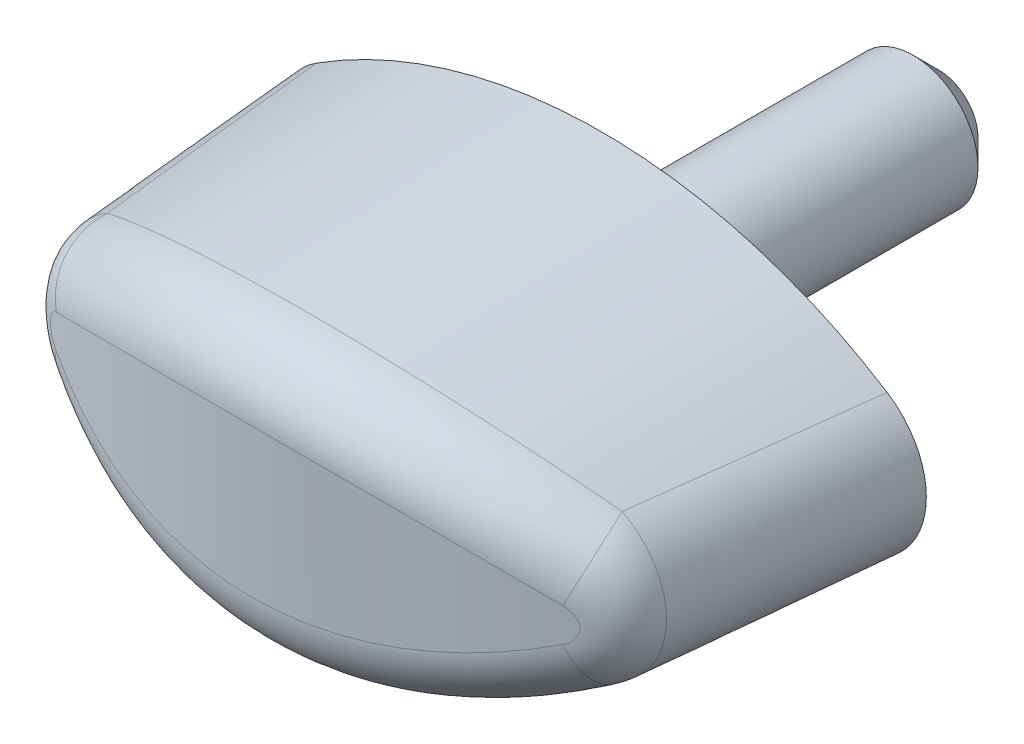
ISO-10303-21;
HEADER;
FILE_DESCRIPTION(('STEP AP214'),'2;1');
FILE_NAME('part.step','',(''),(''),'','','');
FILE_SCHEMA(('AUTOMOTIVE_DESIGN { 1 0 10303 214 1 1 1 1 }'));
ENDSEC;
DATA;
#1=APPLICATION_CONTEXT('core data for automotive mechanical design processes');
#2=APPLICATION_PROTOCOL_DEFINITION('international standard','automotive_design',2000,#1);
#3=PRODUCT_CONTEXT('',#1,'mechanical');
#4=PRODUCT('Part','Part','',(#3));
#5=PRODUCT_RELATED_PRODUCT_CATEGORY('part','',(#4));
#6=PRODUCT_DEFINITION_FORMATION('','',#4);
#7=PRODUCT_DEFINITION_CONTEXT('part definition',#1,'design');
#8=PRODUCT_DEFINITION('design','',#6,#7);
#9=PRODUCT_DEFINITION_SHAPE('','',#8);
#10=(LENGTH_UNIT() NAMED_UNIT(*) SI_UNIT(.MILLI.,.METRE.));
#11=(NAMED_UNIT(*) PLANE_ANGLE_UNIT() SI_UNIT($,.RADIAN.));
#12=(NAMED_UNIT(*) SI_UNIT($,.STERADIAN.) SOLID_ANGLE_UNIT());
#13=UNCERTAINTY_MEASURE_WITH_UNIT(LENGTH_MEASURE(1.E-05),#10,'distance_accuracy_value','');
#14=(GEOMETRIC_REPRESENTATION_CONTEXT(3) GLOBAL_UNCERTAINTY_ASSIGNED_CONTEXT((#13)) GLOBAL_UNIT_ASSIGNED_CONTEXT((#10,
#11,#12)) REPRESENTATION_CONTEXT('',''));
#15=CARTESIAN_POINT('',(0.,0.,0.));
#16=DIRECTION('',(0.,0.,1.));
#17=DIRECTION('',(1.,0.,0.));
#18=AXIS2_PLACEMENT_3D('',#15,#16,#17);
#19=CARTESIAN_POINT('',(0.,11.6598837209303,0.4));
#20=DIRECTION('',(0.,0.,-1.));
#21=DIRECTION('',(1.,0.,0.));
#22=AXIS2_PLACEMENT_3D('',#19,#20,#21);
#23=CONICAL_SURFACE('',#22,16.4098837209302,0.05235987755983);
#24=CARTESIAN_POINT('',(4.70584696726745,-2.46329452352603,29.4670744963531));
#25=CARTESIAN_POINT('',(6.4500654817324,-1.86614656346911,29.7562441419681));
#26=CARTESIAN_POINT('',(6.4500654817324,0.,29.7562441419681));
#27=CARTESIAN_POINT('',(6.4500654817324,1.8661465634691,29.7562441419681));
#28=CARTESIAN_POINT('',(4.70584696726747,2.46329452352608,29.4670744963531));
#29=CARTESIAN_POINT('',(4.81099114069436,-2.45769434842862,28.9339308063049));
#30=CARTESIAN_POINT('',(6.53960510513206,-1.8529266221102,29.2159231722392));
#31=CARTESIAN_POINT('',(6.53980978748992,0.,29.2146516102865));
#32=CARTESIAN_POINT('',(6.53960510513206,1.85292662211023,29.2159231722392));
#33=CARTESIAN_POINT('',(4.81099114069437,2.45769434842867,28.9339308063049));
#34=CARTESIAN_POINT('',(4.91292012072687,-2.45212800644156,28.4003699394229));
#35=CARTESIAN_POINT('',(6.62664245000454,-1.8402282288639,28.6746177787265));
#36=CARTESIAN_POINT('',(6.62682706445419,0.,28.6734280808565));
#37=CARTESIAN_POINT('',(6.62664245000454,1.84022822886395,28.6746177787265));
#38=CARTESIAN_POINT('',(4.91292012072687,2.45212800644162,28.4003699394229));
#39=CARTESIAN_POINT('',(5.11123585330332,-2.44106333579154,27.3325683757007));
#40=CARTESIAN_POINT('',(6.79601117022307,-1.81579592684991,27.5927554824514));
#41=CARTESIAN_POINT('',(6.79620098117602,0.,27.5915534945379));
#42=CARTESIAN_POINT('',(6.79601117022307,1.81579592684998,27.5927554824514));
#43=CARTESIAN_POINT('',(5.11123585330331,2.4410633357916,27.3325683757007));
#44=CARTESIAN_POINT('',(5.20762271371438,-2.43556500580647,26.7983276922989));
#45=CARTESIAN_POINT('',(6.87839257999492,-1.80405353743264,27.0520085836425));
#46=CARTESIAN_POINT('',(6.878557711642,0.,27.0509024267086));
#47=CARTESIAN_POINT('',(6.87839257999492,1.8040535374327,27.0520085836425));
#48=CARTESIAN_POINT('',(5.20762271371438,2.43556500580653,26.7983276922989));
#49=CARTESIAN_POINT('',(5.39573997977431,-2.42463686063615,25.7293366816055));
#50=CARTESIAN_POINT('',(7.03923930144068,-1.78138091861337,25.9711192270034));
#51=CARTESIAN_POINT('',(7.03940190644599,0.,25.9700229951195));
#52=CARTESIAN_POINT('',(7.03923930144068,1.78138091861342,25.9711192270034));
#53=CARTESIAN_POINT('',(5.39573997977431,2.42463686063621,25.7293366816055));
#54=CARTESIAN_POINT('',(5.48747070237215,-2.41920704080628,25.194586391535));
#55=CARTESIAN_POINT('',(7.11774407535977,-1.77044405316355,25.4308176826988));
#56=CARTESIAN_POINT('',(7.1178896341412,0.,25.429794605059));
#57=CARTESIAN_POINT('',(7.11774407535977,1.7704440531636,25.4308176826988));
#58=CARTESIAN_POINT('',(5.48747070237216,2.41920704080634,25.194586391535));
#59=CARTESIAN_POINT('',(5.66690755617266,-2.40841518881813,24.1246310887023));
#60=CARTESIAN_POINT('',(7.27140274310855,-1.7492712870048,24.3506398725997));
#61=CARTESIAN_POINT('',(7.27154760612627,0.,24.3496213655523));
#62=CARTESIAN_POINT('',(7.27140274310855,1.74927128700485,24.3506398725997));
#63=CARTESIAN_POINT('',(5.66690755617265,2.40841518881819,24.1246310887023));
#64=CARTESIAN_POINT('',(5.75461366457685,-2.40305315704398,23.5894260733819));
#65=CARTESIAN_POINT('',(7.34658855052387,-1.73903008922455,23.810626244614));
#66=CARTESIAN_POINT('',(7.34671783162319,0.,23.8096765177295));
#67=CARTESIAN_POINT('',(7.34658855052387,1.73903008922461,23.810626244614));
#68=CARTESIAN_POINT('',(5.75461366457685,2.40305315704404,23.5894260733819));
#69=CARTESIAN_POINT('',(6.01246209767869,-2.38706988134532,21.983434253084));
#70=CARTESIAN_POINT('',(7.56739758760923,-1.70927551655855,22.1941390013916));
#71=CARTESIAN_POINT('',(7.56791718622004,0.,22.1903417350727));
#72=CARTESIAN_POINT('',(7.56739758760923,1.70927551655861,22.1941390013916));
#73=CARTESIAN_POINT('',(6.01246209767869,2.38706988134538,21.983434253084));
#74=CARTESIAN_POINT('',(6.17736719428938,-2.37654953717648,20.9120827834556));
#75=CARTESIAN_POINT('',(7.70923415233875,-1.69059687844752,21.1146231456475));
#76=CARTESIAN_POINT('',(7.70966291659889,0.,21.111261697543));
#77=CARTESIAN_POINT('',(7.70923415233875,1.69059687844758,21.1146231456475));
#78=CARTESIAN_POINT('',(6.17736719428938,2.37654953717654,20.9120827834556));
#79=CARTESIAN_POINT('',(6.49623191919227,-2.35577177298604,18.7682719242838));
#80=CARTESIAN_POINT('',(7.98388483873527,-1.65515669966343,18.9568863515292));
#81=CARTESIAN_POINT('',(7.98430780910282,0.,18.9535563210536));
#82=CARTESIAN_POINT('',(7.98388483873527,1.65515669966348,18.9568863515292));
#83=CARTESIAN_POINT('',(6.49623191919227,2.3557717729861,18.7682719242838));
#84=CARTESIAN_POINT('',(6.65019132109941,-2.34551435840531,17.6958125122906));
#85=CARTESIAN_POINT('',(8.11684799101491,-1.63837130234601,17.8779221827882));
#86=CARTESIAN_POINT('',(8.11720678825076,0.,17.8749309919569));
#87=CARTESIAN_POINT('',(8.11684799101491,1.63837130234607,17.8779221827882));
#88=CARTESIAN_POINT('',(6.65019132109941,2.34551435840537,17.6958125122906));
#89=CARTESIAN_POINT('',(6.94917110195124,-2.32525824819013,15.5503775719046));
#90=CARTESIAN_POINT('',(8.3754837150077,-1.60635722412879,15.7212543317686));
#91=CARTESIAN_POINT('',(8.37584003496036,0.,15.7182824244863));
#92=CARTESIAN_POINT('',(8.3754837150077,1.60635722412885,15.7212543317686));
#93=CARTESIAN_POINT('',(6.94917110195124,2.32525824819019,15.5503775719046));
#94=CARTESIAN_POINT('',(7.09419410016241,-2.31525947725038,14.4774022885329));
#95=CARTESIAN_POINT('',(8.50126948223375,-1.59111074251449,14.6429515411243));
#96=CARTESIAN_POINT('',(8.50157640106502,0.,14.6402591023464));
#97=CARTESIAN_POINT('',(8.50126948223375,1.59111074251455,14.6429515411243));
#98=CARTESIAN_POINT('',(7.09419410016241,2.31525947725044,14.4774022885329));
#99=CARTESIAN_POINT('',(7.37685619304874,-2.29550976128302,12.3308063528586));
#100=CARTESIAN_POINT('',(8.74687145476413,-1.56190212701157,12.4870684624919));
#101=CARTESIAN_POINT('',(8.7471761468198,0.,12.4843922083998));
#102=CARTESIAN_POINT('',(8.74687145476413,1.56190212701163,12.4870684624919));
#103=CARTESIAN_POINT('',(7.37685619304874,2.29550976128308,12.3308063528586));
#104=CARTESIAN_POINT('',(7.51449534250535,-2.28575881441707,11.2571857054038));
#105=CARTESIAN_POINT('',(8.86677346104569,-1.54792693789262,11.4089915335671));
#106=CARTESIAN_POINT('',(8.86703957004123,0.,11.4065486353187));
#107=CARTESIAN_POINT('',(8.86677346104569,1.54792693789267,11.4089915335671));
#108=CARTESIAN_POINT('',(7.51449534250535,2.28575881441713,11.2571857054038));
#109=CARTESIAN_POINT('',(7.78353291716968,-2.26649617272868,9.10936146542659));
#110=CARTESIAN_POINT('',(9.10156824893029,-1.52105947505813,9.25334077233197));
#111=CARTESIAN_POINT('',(9.10183315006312,0.,9.25090846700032));
#112=CARTESIAN_POINT('',(9.10156824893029,1.5210594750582,9.25334077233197));
#113=CARTESIAN_POINT('',(7.78353291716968,2.26649617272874,9.10936146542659));
#114=CARTESIAN_POINT('',(7.91493102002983,-2.25698449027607,8.03515784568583));
#115=CARTESIAN_POINT('',(9.21652871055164,-1.50815718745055,8.17534808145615));
#116=CARTESIAN_POINT('',(9.21676305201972,0.,8.17311187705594));
#117=CARTESIAN_POINT('',(9.21652871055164,1.50815718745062,8.17534808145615));
#118=CARTESIAN_POINT('',(7.91493102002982,2.25698449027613,8.03515784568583));
#119=CARTESIAN_POINT('',(8.17235300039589,-2.23819295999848,5.88631382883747));
#120=CARTESIAN_POINT('',(9.44216335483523,-1.48328190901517,6.01979713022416));
#121=CARTESIAN_POINT('',(9.44239554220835,0.,6.01757645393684));
#122=CARTESIAN_POINT('',(9.44216335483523,1.48328190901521,6.01979713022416));
#123=CARTESIAN_POINT('',(8.1723530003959,2.23819295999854,5.88631382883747));
#124=CARTESIAN_POINT('',(8.29837686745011,-2.22891311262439,4.81167343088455));
#125=CARTESIAN_POINT('',(9.55289252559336,-1.47130097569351,4.94188033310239));
#126=CARTESIAN_POINT('',(9.55309812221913,0.,4.93983762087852));
#127=CARTESIAN_POINT('',(9.55289252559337,1.47130097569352,4.94188033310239));
#128=CARTESIAN_POINT('',(8.29837686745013,2.22891311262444,4.81167343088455));
#129=CARTESIAN_POINT('',(8.66939307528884,-2.20141530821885,1.58788070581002));
#130=CARTESIAN_POINT('',(9.87884646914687,-1.43663651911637,1.7155180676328));
#131=CARTESIAN_POINT('',(9.87967438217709,0.,1.70733854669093));
#132=CARTESIAN_POINT('',(9.87884646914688,1.43663651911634,1.7155180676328));
#133=CARTESIAN_POINT('',(8.66939307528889,2.20141530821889,1.58788070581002));
#134=CARTESIAN_POINT('',(8.90741335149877,-2.18353306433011,-0.561816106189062));
#135=CARTESIAN_POINT('',(10.0894167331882,-1.41505378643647,-0.440319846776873));
#136=CARTESIAN_POINT('',(10.0900893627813,0.,-0.447379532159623));
#137=CARTESIAN_POINT('',(10.0894167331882,1.41505378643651,-0.440319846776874));
#138=CARTESIAN_POINT('',(8.90741335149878,2.18353306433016,-0.561816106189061));
#139=CARTESIAN_POINT('',(9.36897770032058,-2.14860484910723,-4.86221523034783));
#140=CARTESIAN_POINT('',(10.4990051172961,-1.37439669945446,-4.74979952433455));
#141=CARTESIAN_POINT('',(10.4996664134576,0.,-4.75677472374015));
#142=CARTESIAN_POINT('',(10.4990051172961,1.37439669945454,-4.74979952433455));
#143=CARTESIAN_POINT('',(9.36897770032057,2.1486048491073,-4.86221523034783));
#144=CARTESIAN_POINT('',(9.5925220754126,-2.131558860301,-7.01291752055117));
#145=CARTESIAN_POINT('',(10.6982780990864,-1.35528820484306,-6.90534782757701));
#146=CARTESIAN_POINT('',(10.698828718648,0.,-6.91145183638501));
#147=CARTESIAN_POINT('',(10.6982780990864,1.35528820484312,-6.90534782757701));
#148=CARTESIAN_POINT('',(9.5925220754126,2.13155886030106,-7.01291752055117));
#149=CARTESIAN_POINT('',(10.0280362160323,-2.09824251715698,-11.3157174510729));
#150=CARTESIAN_POINT('',(11.0876591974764,-1.31907365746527,-11.2153558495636));
#151=CARTESIAN_POINT('',(11.0882115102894,0.,-11.2214600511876));
#152=CARTESIAN_POINT('',(11.0876591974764,1.31907365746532,-11.2153558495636));
#153=CARTESIAN_POINT('',(10.0280362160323,2.09824251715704,-11.3157174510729));
#154=CARTESIAN_POINT('',(10.2400027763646,-2.08197237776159,-13.467815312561));
#155=CARTESIAN_POINT('',(11.2779534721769,-1.30194412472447,-13.3713380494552));
#156=CARTESIAN_POINT('',(11.2784295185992,0.,-13.3767911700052));
#157=CARTESIAN_POINT('',(11.2779534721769,1.30194412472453,-13.3713380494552));
#158=CARTESIAN_POINT('',(10.2400027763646,2.08197237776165,-13.467815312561));
#159=CARTESIAN_POINT('',(10.6542513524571,-2.05016216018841,-17.7726827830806));
#160=CARTESIAN_POINT('',(11.6509526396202,-1.26934468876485,-17.6822814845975));
#161=CARTESIAN_POINT('',(11.651405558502,0.,-17.6875648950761));
#162=CARTESIAN_POINT('',(11.6509526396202,1.26934468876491,-17.6822814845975));
#163=CARTESIAN_POINT('',(10.6542513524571,2.05016216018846,-17.7726827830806));
#164=CARTESIAN_POINT('',(10.8565332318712,-2.03462209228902,-19.9254524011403));
#165=CARTESIAN_POINT('',(11.8338028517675,-1.25385715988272,-19.8384937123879));
#166=CARTESIAN_POINT('',(11.8341634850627,0.,-19.8430075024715));
#167=CARTESIAN_POINT('',(11.8338028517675,1.25385715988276,-19.8384937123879));
#168=CARTESIAN_POINT('',(10.8565332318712,2.03462209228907,-19.9254524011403));
#169=CARTESIAN_POINT('',(11.0549480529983,-2.01942199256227,-22.0784618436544));
#170=CARTESIAN_POINT('',(12.0139589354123,-1.23900819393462,-21.9985010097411));
#171=CARTESIAN_POINT('',(12.0139589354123,0.,-21.9985010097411));
#172=CARTESIAN_POINT('',(12.0139589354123,1.23900819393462,-21.9985010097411));
#173=CARTESIAN_POINT('',(11.0549480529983,2.0194219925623,-22.0784618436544));
#174=(BOUNDED_SURFACE() B_SPLINE_SURFACE(3,2,((#24,#25,#26,#27,#28),(#29,#30,#31,#32,#33),(#34,
#35,#36,#37,#38),(#39,#40,#41,#42,#43),(#44,#45,#46,#47,#48),(#49,#50,#51,#52,#53),(#54,#55,#56,
#57,#58),(#59,#60,#61,#62,#63),(#64,#65,#66,#67,#68),(#69,#70,#71,#72,#73),(#74,#75,#76,#77,
#78),(#79,#80,#81,#82,#83),(#84,#85,#86,#87,#88),(#89,#90,#91,#92,#93),(#94,#95,#96,#97,#98),
(#99,#100,#101,#102,#103),(#104,#105,#106,#107,#108),(#109,#110,#111,#112,#113),(#114,#115,#116,
#117,#118),(#119,#120,#121,#122,#123),(#124,#125,#126,#127,#128),(#129,#130,#131,#132,#133),
(#134,#135,#136,#137,#138),(#139,#140,#141,#142,#143),(#144,#145,#146,#147,#148),(#149,#150,
#151,#152,#153),(#154,#155,#156,#157,#158),(#159,#160,#161,#162,#163),(#164,#165,#166,#167,
#168),(#169,#170,#171,#172,#173)),.UNSPECIFIED.,.F.,.F.,.F.) B_SPLINE_SURFACE_WITH_KNOTS((4,2,2,
2,2,2,2,2,2,2,2,2,2,2,4),(3,2,3),(0.,1.62122580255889,3.24242004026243,4.86350377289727,
6.48459668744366,9.72621281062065,12.9678959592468,16.2086244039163,19.449328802,
22.6902003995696,25.9310782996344,32.410803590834,38.8903934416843,45.3717681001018,
51.8532339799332),(0.,0.5,1.),
.UNSPECIFIED.) GEOMETRIC_REPRESENTATION_ITEM() RATIONAL_B_SPLINE_SURFACE(((1.,0.812400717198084,
1.,0.812400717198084,1.),(1.,0.814361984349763,1.,0.814361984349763,1.),(1.,0.816241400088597,
1.,0.816241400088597,1.),(1.,0.81985834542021,1.,0.81985834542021,1.),(1.,0.821595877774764,1.,
0.821595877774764,1.),(1.,0.824950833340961,1.,0.824950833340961,1.),(1.,0.826568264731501,1.,
0.826568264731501,1.),(1.,0.829698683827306,1.,0.829698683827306,1.),(1.,0.831211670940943,1.,
0.831211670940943,1.),(1.,0.835613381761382,1.,0.835613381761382,1.),(1.,0.83836543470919,1.,
0.83836543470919,1.),(1.,0.843581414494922,1.,0.843581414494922,1.),(1.,0.846045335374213,1.,
0.846045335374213,1.),(1.,0.850736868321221,1.,0.850736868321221,1.),(1.,0.852964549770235,1.,
0.852964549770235,1.),(1.,0.857223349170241,1.,0.857223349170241,1.),(1.,0.859254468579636,1.,
0.859254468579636,1.),(1.,0.863149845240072,1.,0.863149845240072,1.),(1.,0.865014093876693,1.,
0.865014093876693,1.),(1.,0.868598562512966,1.,0.868598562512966,1.),(1.,0.870318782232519,1.,
0.870318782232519,1.),(1.,0.875290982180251,1.,0.875290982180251,1.),(1.,0.878355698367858,1.,
0.878355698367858,1.),(1.,0.884095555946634,1.,0.884095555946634,1.),(1.,0.886770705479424,1.,
0.886770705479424,1.),(1.,0.891808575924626,1.,0.891808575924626,1.),(1.,0.894171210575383,1.,
0.894171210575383,1.),(1.,0.898636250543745,1.,0.898636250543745,1.),(1.,0.900738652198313,1.,
0.900738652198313,1.),(1.,0.902737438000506,1.,0.902737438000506,1.))) REPRESENTATION_ITEM('') SURFACE());
#175=CARTESIAN_POINT('',(11.0549480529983,-2.01942199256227,-22.0784618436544));
#176=CARTESIAN_POINT('',(10.8565332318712,-2.03462209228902,-19.9254524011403));
#177=CARTESIAN_POINT('',(10.6542513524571,-2.05016216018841,-17.7726827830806));
#178=CARTESIAN_POINT('',(10.2400027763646,-2.08197237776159,-13.467815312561));
#179=CARTESIAN_POINT('',(10.0280362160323,-2.09824251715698,-11.3157174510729));
#180=CARTESIAN_POINT('',(9.5925220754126,-2.131558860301,-7.01291752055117));
#181=CARTESIAN_POINT('',(9.36897770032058,-2.14860484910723,-4.86221523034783));
#182=CARTESIAN_POINT('',(8.90741335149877,-2.18353306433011,-0.56181610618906));
#183=CARTESIAN_POINT('',(8.66939307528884,-2.20141530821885,1.58788070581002));
#184=CARTESIAN_POINT('',(8.29837686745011,-2.22891311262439,4.81167343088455));
#185=CARTESIAN_POINT('',(8.17235300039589,-2.23819295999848,5.88631382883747));
#186=CARTESIAN_POINT('',(7.91493102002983,-2.25698449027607,8.03515784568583));
#187=CARTESIAN_POINT('',(7.78353291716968,-2.26649617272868,9.10936146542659));
#188=CARTESIAN_POINT('',(7.51449534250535,-2.28575881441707,11.2571857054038));
#189=CARTESIAN_POINT('',(7.37685619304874,-2.29550976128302,12.3308063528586));
#190=CARTESIAN_POINT('',(7.09419410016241,-2.31525947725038,14.4774022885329));
#191=CARTESIAN_POINT('',(6.94917110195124,-2.32525824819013,15.5503775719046));
#192=CARTESIAN_POINT('',(6.65019132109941,-2.34551435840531,17.6958125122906));
#193=CARTESIAN_POINT('',(6.49623191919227,-2.35577177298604,18.7682719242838));
#194=CARTESIAN_POINT('',(6.17736719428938,-2.37654953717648,20.9120827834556));
#195=CARTESIAN_POINT('',(6.01246209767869,-2.38706988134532,21.983434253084));
#196=CARTESIAN_POINT('',(5.75461366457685,-2.40305315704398,23.5894260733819));
#197=CARTESIAN_POINT('',(5.66690755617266,-2.40841518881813,24.1246310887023));
#198=CARTESIAN_POINT('',(5.48747070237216,-2.41920704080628,25.194586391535));
#199=CARTESIAN_POINT('',(5.39573997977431,-2.42463686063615,25.7293366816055));
#200=CARTESIAN_POINT('',(5.20762271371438,-2.43556500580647,26.7983276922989));
#201=CARTESIAN_POINT('',(5.11123585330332,-2.44106333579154,27.3325683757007));
#202=CARTESIAN_POINT('',(4.91292012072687,-2.45212800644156,28.4003699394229));
#203=CARTESIAN_POINT('',(4.81099114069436,-2.45769434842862,28.9339308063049));
#204=CARTESIAN_POINT('',(4.70584696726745,-2.46329452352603,29.4670744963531));
#205=B_SPLINE_CURVE_WITH_KNOTS('',3,(#175,#176,#177,#178,#179,#180,#181,#182,#183,#184,#185,
#186,#187,#188,#189,#190,#191,#192,#193,#194,#195,#196,#197,#198,#199,#200,#201,#202,#203,#204),
.UNSPECIFIED.,.F.,.F.,(4,2,2,2,2,2,2,2,2,2,2,2,2,2,4),(0.,6.48146587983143,12.9628405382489,
19.4424303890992,25.9221556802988,29.1630335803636,32.4039051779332,35.644609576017,
38.8853380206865,42.1270211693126,45.3686372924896,46.989730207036,48.6108139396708,
50.2320081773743,51.8532339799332),.UNSPECIFIED.);
#206=CARTESIAN_POINT('',(8.7988338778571,-2.1916434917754,0.4));
#207=VERTEX_POINT('',#206);
#208=CARTESIAN_POINT('',(7.9512389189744,-2.25431991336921,7.728160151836));
#209=VERTEX_POINT('',#208);
#210=EDGE_CURVE('E87',#207,#209,#205,.T.);
#211=ORIENTED_EDGE('',*,*,#210,.T.);
#212=CARTESIAN_POINT('',(12.2736553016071,2.63373473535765,6.42417025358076));
#213=CARTESIAN_POINT('',(12.77636524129,1.81758842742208,5.96291903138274));
#214=CARTESIAN_POINT('',(12.461046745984,1.36138005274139,5.0551674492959));
#215=CARTESIAN_POINT('',(11.9706353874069,2.32801953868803,6.70223633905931));
#216=CARTESIAN_POINT('',(12.488563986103,1.46779976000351,6.24823784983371));
#217=CARTESIAN_POINT('',(12.1548919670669,1.01140775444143,5.30253483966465));
#218=CARTESIAN_POINT('',(11.6512904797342,2.03180971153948,6.97619825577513));
#219=CARTESIAN_POINT('',(12.1856194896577,1.12905521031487,6.52923063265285));
#220=CARTESIAN_POINT('',(11.8320426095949,0.672173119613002,5.54625116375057));
#221=CARTESIAN_POINT('',(10.9790357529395,1.45993567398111,7.51185168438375));
#222=CARTESIAN_POINT('',(11.5434286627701,0.469016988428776,7.08373716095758));
#223=CARTESIAN_POINT('',(11.1519903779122,0.0169905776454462,6.02276806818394));
#224=CARTESIAN_POINT('',(10.6260581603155,1.18431503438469,7.77351676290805));
#225=CARTESIAN_POINT('',(11.2032688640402,0.147847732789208,7.35728582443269));
#226=CARTESIAN_POINT('',(10.7947181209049,-0.298907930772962,6.25554513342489));
#227=CARTESIAN_POINT('',(9.88384439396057,0.654270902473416,8.28140086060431));
#228=CARTESIAN_POINT('',(10.4818894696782,-0.476462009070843,7.89399763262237));
#229=CARTESIAN_POINT('',(10.043051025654,-0.906621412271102,6.70735846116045));
#230=CARTESIAN_POINT('',(9.49433510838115,0.400039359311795,8.52747593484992));
#231=CARTESIAN_POINT('',(10.0995869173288,-0.779098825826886,8.15686533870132));
#232=CARTESIAN_POINT('',(9.64837629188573,-1.19821811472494,6.9262666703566));
#233=CARTESIAN_POINT('',(8.68214605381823,-0.0813138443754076,8.99666377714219));
#234=CARTESIAN_POINT('',(9.29411568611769,-1.35935418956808,8.66446610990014));
#235=CARTESIAN_POINT('',(8.82500204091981,-1.75049232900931,7.34365583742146));
#236=CARTESIAN_POINT('',(8.25949669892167,-0.308459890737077,9.21979717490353));
#237=CARTESIAN_POINT('',(8.87032540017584,-1.63643874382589,8.90879967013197));
#238=CARTESIAN_POINT('',(8.39633371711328,-2.01119765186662,7.54215514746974));
#239=CARTESIAN_POINT('',(7.51250999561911,-0.669080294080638,9.57585506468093));
#240=CARTESIAN_POINT('',(8.1142895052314,-2.08135871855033,9.30318467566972));
#241=CARTESIAN_POINT('',(7.63837958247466,-2.42521175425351,7.85890398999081));
#242=CARTESIAN_POINT('',(7.19626998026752,-0.810334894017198,9.71588520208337));
#243=CARTESIAN_POINT('',(7.7906787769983,-2.25768434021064,9.46013499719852));
#244=CARTESIAN_POINT('',(7.31740432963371,-2.58741623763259,7.98347469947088));
#245=CARTESIAN_POINT('',(6.54875624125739,-1.0761955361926,9.98019448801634));
#246=CARTESIAN_POINT('',(7.1220456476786,-2.59295898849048,9.75945606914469));
#247=CARTESIAN_POINT('',(6.66001964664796,-2.89276100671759,8.21860405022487));
#248=CARTESIAN_POINT('',(6.21748628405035,-1.20080571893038,10.1044775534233));
#249=CARTESIAN_POINT('',(6.77706313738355,-2.75154103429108,9.90151071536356));
#250=CARTESIAN_POINT('',(6.32361408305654,-3.03590603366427,8.32916617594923));
#251=CARTESIAN_POINT('',(5.5419987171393,-1.43154926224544,10.3350946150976));
#252=CARTESIAN_POINT('',(6.06709303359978,-3.04821010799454,10.1678497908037));
#253=CARTESIAN_POINT('',(5.63749685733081,-3.3010106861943,8.53432294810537));
#254=CARTESIAN_POINT('',(5.19781990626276,-1.53773331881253,10.4414778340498));
#255=CARTESIAN_POINT('',(5.70236920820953,-3.18593239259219,10.2918123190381));
#256=CARTESIAN_POINT('',(5.28782503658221,-3.4230284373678,8.62896138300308));
#257=CARTESIAN_POINT('',(4.4974353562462,-1.73049960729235,10.6348557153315));
#258=CARTESIAN_POINT('',(4.95349171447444,-3.43840857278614,10.5193952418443));
#259=CARTESIAN_POINT('',(4.57612718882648,-3.64456593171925,8.80099020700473));
#260=CARTESIAN_POINT('',(4.14123524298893,-1.81709086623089,10.7218593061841));
#261=CARTESIAN_POINT('',(4.56978035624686,-3.55272247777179,10.6226225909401));
#262=CARTESIAN_POINT('',(4.21410693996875,-3.7440960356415,8.87838853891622));
#263=CARTESIAN_POINT('',(3.41587206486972,-1.96994848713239,10.8755006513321));
#264=CARTESIAN_POINT('',(3.78197068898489,-3.75629507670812,10.8065608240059));
#265=CARTESIAN_POINT('',(3.4767818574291,-3.91980987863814,9.0150677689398));
#266=CARTESIAN_POINT('',(3.04662786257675,-2.03604601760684,10.9419692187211));
#267=CARTESIAN_POINT('',(3.37845029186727,-3.84489587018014,10.8866793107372));
#268=CARTESIAN_POINT('',(3.10139367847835,-3.99579968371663,9.07419815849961));
#269=CARTESIAN_POINT('',(2.30057207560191,-2.14576562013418,11.0521826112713));
#270=CARTESIAN_POINT('',(2.55758944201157,-3.99301523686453,11.0205232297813));
#271=CARTESIAN_POINT('',(2.34284328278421,-4.12194657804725,9.1722439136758));
#272=CARTESIAN_POINT('',(1.92376045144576,-2.18938757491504,11.0959273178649));
#273=CARTESIAN_POINT('',(2.14118128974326,-4.05216439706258,11.0739141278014));
#274=CARTESIAN_POINT('',(1.95968102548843,-4.17210353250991,9.21115917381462));
#275=CARTESIAN_POINT('',(1.16547561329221,-2.25331722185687,11.1597168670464));
#276=CARTESIAN_POINT('',(1.29920905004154,-4.13924602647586,11.1522052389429));
#277=CARTESIAN_POINT('',(1.18856908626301,-4.24561030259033,9.26790631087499));
#278=CARTESIAN_POINT('',(0.784000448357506,-2.27361479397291,11.1797514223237));
#279=CARTESIAN_POINT('',(0.874763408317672,-4.16692724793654,11.1768777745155));
#280=CARTESIAN_POINT('',(0.800617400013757,-4.268948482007,9.28572903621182));
#281=CARTESIAN_POINT('',(0.0199004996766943,-2.290447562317,11.1956061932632));
#282=CARTESIAN_POINT('',(0.0226123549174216,-4.18984716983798,11.1965410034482));
#283=CARTESIAN_POINT('',(0.0235328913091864,-4.28829764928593,9.29983342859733));
#284=CARTESIAN_POINT('',(-0.362724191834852,-2.28698461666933,11.1914283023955));
#285=CARTESIAN_POINT('',(-0.403874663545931,-4.18502393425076,11.1914769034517));
#286=CARTESIAN_POINT('',(-0.365599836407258,-4.28431077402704,9.29611678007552));
#287=CARTESIAN_POINT('',(-1.09251137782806,-2.25771933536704,11.1603720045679));
#288=CARTESIAN_POINT('',(-1.21714276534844,-4.14478447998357,11.1534273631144));
#289=CARTESIAN_POINT('',(-1.1077774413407,-4.25064756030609,9.26848911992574));
#290=CARTESIAN_POINT('',(-1.43986323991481,-2.23388655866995,11.1354999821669));
#291=CARTESIAN_POINT('',(-1.60313363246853,-4.11216345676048,11.1229997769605));
#292=CARTESIAN_POINT('',(-1.46101686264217,-4.22323617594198,9.24636298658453));
#293=CARTESIAN_POINT('',(-2.13022718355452,-2.16690650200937,11.0661333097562));
#294=CARTESIAN_POINT('',(-2.36837418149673,-4.0207896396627,11.0383152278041));
#295=CARTESIAN_POINT('',(-2.16303670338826,-4.1462068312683,9.18465444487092));
#296=CARTESIAN_POINT('',(-2.47323915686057,-2.12375874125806,11.0216381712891));
#297=CARTESIAN_POINT('',(-2.74679844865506,-3.96224210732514,10.9842469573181));
#298=CARTESIAN_POINT('',(-2.51181701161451,-4.09658831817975,9.14507160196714));
#299=CARTESIAN_POINT('',(-3.15239788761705,-2.0188855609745,10.9138714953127));
#300=CARTESIAN_POINT('',(-3.49281583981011,-3.82063327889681,10.8538800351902));
#301=CARTESIAN_POINT('',(-3.20232696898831,-3.97600015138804,9.04920244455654));
#302=CARTESIAN_POINT('',(-3.48854920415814,-1.95717293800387,10.850612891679));
#303=CARTESIAN_POINT('',(-3.85973014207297,-3.73787970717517,10.7778624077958));
#304=CARTESIAN_POINT('',(-3.54406130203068,-3.9050452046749,8.99292763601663));
#305=CARTESIAN_POINT('',(-4.15218576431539,-1.81612013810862,10.7064235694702));
#306=CARTESIAN_POINT('',(-4.57986365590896,-3.54993554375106,10.6056601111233));
#307=CARTESIAN_POINT('',(-4.21862845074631,-3.74288760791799,8.86465691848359));
#308=CARTESIAN_POINT('',(-4.47967146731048,-1.73678089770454,10.6254937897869));
#309=CARTESIAN_POINT('',(-4.93256877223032,-3.44508419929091,10.5097831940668));
#310=CARTESIAN_POINT('',(-4.55146173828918,-3.65168603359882,8.79266184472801));
#311=CARTESIAN_POINT('',(-5.33834884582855,-1.50336492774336,10.3880340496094));
#312=CARTESIAN_POINT('',(-5.84824463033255,-3.1398465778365,10.2313938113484));
#313=CARTESIAN_POINT('',(-5.42401275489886,-3.38340927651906,8.58141783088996));
#314=CARTESIAN_POINT('',(-5.86060548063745,-1.33461753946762,10.2169608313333));
#315=CARTESIAN_POINT('',(-6.39901993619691,-2.92194339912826,10.0333261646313));
#316=CARTESIAN_POINT('',(-5.95455146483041,-3.18949529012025,8.42923121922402));
#317=CARTESIAN_POINT('',(-6.87165225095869,-0.956525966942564,9.8357352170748));
#318=CARTESIAN_POINT('',(-7.45224777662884,-2.44011778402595,9.59773501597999));
#319=CARTESIAN_POINT('',(-6.98125997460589,-2.75514849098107,8.09009318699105));
#320=CARTESIAN_POINT('',(-7.36039727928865,-0.747128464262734,9.62553151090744));
#321=CARTESIAN_POINT('',(-7.95422429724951,-2.17755748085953,9.36140686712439));
#322=CARTESIAN_POINT('',(-7.47738346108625,-2.51465458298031,7.9030961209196));
#323=CARTESIAN_POINT('',(-8.2687230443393,-0.308660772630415,9.18834750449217));
#324=CARTESIAN_POINT('',(-8.87615322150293,-1.63473557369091,8.8761543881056));
#325=CARTESIAN_POINT('',(-8.39902024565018,-2.01124908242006,7.51417754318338));
#326=CARTESIAN_POINT('',(-8.69074709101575,-0.0818982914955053,8.96348160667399));
#327=CARTESIAN_POINT('',(-9.29909987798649,-1.35812204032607,8.63022658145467));
#328=CARTESIAN_POINT('',(-8.82704107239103,-1.7509758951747,7.31413700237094));
#329=CARTESIAN_POINT('',(-9.50184790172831,0.398618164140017,8.49075141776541));
#330=CARTESIAN_POINT('',(-10.1030808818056,-0.778903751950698,8.11939339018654));
#331=CARTESIAN_POINT('',(-9.64928434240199,-1.19964640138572,6.89359656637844));
#332=CARTESIAN_POINT('',(-9.89088711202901,0.652402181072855,8.24286156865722));
#333=CARTESIAN_POINT('',(-10.4847325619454,-0.476820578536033,7.85488015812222));
#334=CARTESIAN_POINT('',(-10.043468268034,-0.90855583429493,6.67307393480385));
#335=CARTESIAN_POINT('',(-10.6341657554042,1.18282304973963,7.72994588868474));
#336=CARTESIAN_POINT('',(-11.2067754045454,0.14785496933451,7.31344325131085));
#337=CARTESIAN_POINT('',(-10.7961834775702,-0.300397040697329,6.21678451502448));
#338=CARTESIAN_POINT('',(-10.9884978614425,1.45939519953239,7.46496900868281));
#339=CARTESIAN_POINT('',(-11.5480825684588,0.470092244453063,7.03671780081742));
#340=CARTESIAN_POINT('',(-11.15480973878,0.0165976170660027,5.98106127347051));
#341=CARTESIAN_POINT('',(-11.6630745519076,2.03316508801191,6.92254511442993));
#342=CARTESIAN_POINT('',(-12.192183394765,1.13220519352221,6.47577654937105));
#343=CARTESIAN_POINT('',(-11.8371735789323,0.673960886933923,5.49852136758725));
#344=CARTESIAN_POINT('',(-11.9833943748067,2.3303147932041,6.6451276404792));
#345=CARTESIAN_POINT('',(-12.4959110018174,1.47195598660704,6.19152525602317));
#346=CARTESIAN_POINT('',(-12.1609881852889,1.01427504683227,5.25173098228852));
#347=CARTESIAN_POINT('',(-12.2872602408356,2.6369720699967,6.36351191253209));
#348=CARTESIAN_POINT('',(-12.784384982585,1.82275378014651,5.90284195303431));
#349=CARTESIAN_POINT('',(-12.4679757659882,1.36532754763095,5.00120583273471));
#350=(BOUNDED_SURFACE() B_SPLINE_SURFACE(3,2,((#212,#213,#214),(#215,#216,#217),(#218,#219,
#220),(#221,#222,#223),(#224,#225,#226),(#227,#228,#229),(#230,#231,#232),(#233,#234,#235),
(#236,#237,#238),(#239,#240,#241),(#242,#243,#244),(#245,#246,#247),(#248,#249,#250),(#251,#252,
#253),(#254,#255,#256),(#257,#258,#259),(#260,#261,#262),(#263,#264,#265),(#266,#267,#268),
(#269,#270,#271),(#272,#273,#274),(#275,#276,#277),(#278,#279,#280),(#281,#282,#283),(#284,#285,
#286),(#287,#288,#289),(#290,#291,#292),(#293,#294,#295),(#296,#297,#298),(#299,#300,#301),
(#302,#303,#304),(#305,#306,#307),(#308,#309,#310),(#311,#312,#313),(#314,#315,#316),(#317,#318,
#319),(#320,#321,#322),(#323,#324,#325),(#326,#327,#328),(#329,#330,#331),(#332,#333,#334),
(#335,#336,#337),(#338,#339,#340),(#341,#342,#343),(#344,#345,#346),(#347,#348,#349)),
.UNSPECIFIED.,.F.,.F.,.F.) B_SPLINE_SURFACE_WITH_KNOTS((4,2,2,2,2,2,2,2,2,2,2,2,2,2,2,2,2,2,2,2,
2,2,4),(3,3),(0.,1.43034531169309,2.86363646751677,4.30865830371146,5.75236916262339,
6.76716067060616,7.78169926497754,8.79340069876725,9.8046350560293,10.8239914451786,
11.8433531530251,12.8631569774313,13.8828810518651,14.8138970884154,15.7449363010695,
16.6753352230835,17.6056847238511,19.1530154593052,20.7023896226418,22.1463512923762,
23.5919354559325,25.0335479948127,26.4719020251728),(0.,1.),
.UNSPECIFIED.) GEOMETRIC_REPRESENTATION_ITEM() RATIONAL_B_SPLINE_SURFACE(((1.,0.882886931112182,
1.),(1.,0.87597346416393,1.),(1.,0.868817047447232,1.),(1.,0.854183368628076,1.),(1.,
0.846705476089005,1.),(1.,0.831562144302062,1.),(1.,0.823895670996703,1.),(1.,0.808697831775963,
1.),(1.,0.801166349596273,1.),(1.,0.788726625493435,1.),(1.,0.783703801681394,1.),(1.,
0.774011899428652,1.),(1.,0.769342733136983,1.),(1.,0.760510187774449,1.),(1.,0.756345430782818,
1.),(1.,0.748652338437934,1.),(1.,0.745123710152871,1.),(1.,0.738813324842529,1.),(1.,
0.736037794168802,1.),(1.,0.731393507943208,1.),(1.,0.729524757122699,1.),(1.,0.726782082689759,
1.),(1.,0.725908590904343,1.),(1.,0.725201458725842,1.),(1.,0.72536773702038,1.),(1.,
0.726671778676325,1.),(1.,0.727723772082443,1.),(1.,0.730643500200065,1.),(1.,0.732511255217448,
1.),(1.,0.73698826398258,1.),(1.,0.739597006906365,1.),(1.,0.745460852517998,1.),(1.,
0.748715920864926,1.),(1.,0.758106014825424,1.),(1.,0.764719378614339,1.),(1.,0.778932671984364,
1.),(1.,0.786533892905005,1.),(1.,0.801708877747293,1.),(1.,0.809249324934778,1.),(1.,
0.824462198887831,1.),(1.,0.832134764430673,1.),(1.,0.847326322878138,1.),(1.,0.854845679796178,
1.),(1.,0.869553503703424,1.),(1.,0.876742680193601,1.),(1.,0.883684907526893,1.))) REPRESENTATION_ITEM('') SURFACE());
#351=CARTESIAN_POINT('',(12.461046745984,1.36138005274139,5.0551674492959));
#352=CARTESIAN_POINT('',(12.1548919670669,1.01140775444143,5.30253483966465));
#353=CARTESIAN_POINT('',(11.8320426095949,0.672173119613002,5.54625116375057));
#354=CARTESIAN_POINT('',(11.1519903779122,0.0169905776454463,6.02276806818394));
#355=CARTESIAN_POINT('',(10.7947181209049,-0.298907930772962,6.25554513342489));
#356=CARTESIAN_POINT('',(10.043051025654,-0.906621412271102,6.70735846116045));
#357=CARTESIAN_POINT('',(9.64837629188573,-1.19821811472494,6.9262666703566));
#358=CARTESIAN_POINT('',(8.82500204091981,-1.75049232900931,7.34365583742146));
#359=CARTESIAN_POINT('',(8.39633371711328,-2.01119765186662,7.54215514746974));
#360=CARTESIAN_POINT('',(7.63837958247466,-2.42521175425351,7.85890398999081));
#361=CARTESIAN_POINT('',(7.31740432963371,-2.58741623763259,7.98347469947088));
#362=CARTESIAN_POINT('',(6.66001964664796,-2.89276100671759,8.21860405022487));
#363=CARTESIAN_POINT('',(6.32361408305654,-3.03590603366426,8.32916617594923));
#364=CARTESIAN_POINT('',(5.63749685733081,-3.3010106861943,8.53432294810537));
#365=CARTESIAN_POINT('',(5.28782503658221,-3.4230284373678,8.62896138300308));
#366=CARTESIAN_POINT('',(4.57612718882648,-3.64456593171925,8.80099020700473));
#367=CARTESIAN_POINT('',(4.21410693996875,-3.7440960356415,8.87838853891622));
#368=CARTESIAN_POINT('',(3.4767818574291,-3.91980987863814,9.0150677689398));
#369=CARTESIAN_POINT('',(3.10139367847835,-3.99579968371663,9.07419815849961));
#370=CARTESIAN_POINT('',(2.34284328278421,-4.12194657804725,9.1722439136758));
#371=CARTESIAN_POINT('',(1.95968102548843,-4.17210353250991,9.21115917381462));
#372=CARTESIAN_POINT('',(1.18856908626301,-4.24561030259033,9.26790631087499));
#373=CARTESIAN_POINT('',(0.800617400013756,-4.268948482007,9.28572903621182));
#374=CARTESIAN_POINT('',(0.0235328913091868,-4.28829764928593,9.29983342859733));
#375=CARTESIAN_POINT('',(-0.365599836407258,-4.28431077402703,9.29611678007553));
#376=CARTESIAN_POINT('',(-1.1077774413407,-4.25064756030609,9.26848911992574));
#377=CARTESIAN_POINT('',(-1.46101686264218,-4.22323617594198,9.24636298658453));
#378=CARTESIAN_POINT('',(-2.16303670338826,-4.1462068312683,9.18465444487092));
#379=CARTESIAN_POINT('',(-2.51181701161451,-4.09658831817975,9.14507160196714));
#380=CARTESIAN_POINT('',(-3.20232696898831,-3.97600015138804,9.04920244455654));
#381=CARTESIAN_POINT('',(-3.54406130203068,-3.9050452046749,8.99292763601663));
#382=CARTESIAN_POINT('',(-4.21862845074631,-3.74288760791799,8.86465691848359));
#383=CARTESIAN_POINT('',(-4.55146173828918,-3.65168603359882,8.79266184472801));
#384=CARTESIAN_POINT('',(-5.42401275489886,-3.38340927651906,8.58141783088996));
#385=CARTESIAN_POINT('',(-5.95455146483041,-3.18949529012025,8.42923121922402));
#386=CARTESIAN_POINT('',(-6.98125997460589,-2.75514849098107,8.09009318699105));
#387=CARTESIAN_POINT('',(-7.47738346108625,-2.51465458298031,7.9030961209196));
#388=CARTESIAN_POINT('',(-8.39902024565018,-2.01124908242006,7.51417754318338));
#389=CARTESIAN_POINT('',(-8.82704107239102,-1.7509758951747,7.31413700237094));
#390=CARTESIAN_POINT('',(-9.64928434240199,-1.19964640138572,6.89359656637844));
#391=CARTESIAN_POINT('',(-10.043468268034,-0.90855583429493,6.67307393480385));
#392=CARTESIAN_POINT('',(-10.7961834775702,-0.300397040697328,6.21678451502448));
#393=CARTESIAN_POINT('',(-11.15480973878,0.0165976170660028,5.98106127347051));
#394=CARTESIAN_POINT('',(-11.8371735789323,0.673960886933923,5.49852136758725));
#395=CARTESIAN_POINT('',(-12.1609881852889,1.01427504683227,5.25173098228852));
#396=CARTESIAN_POINT('',(-12.4679757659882,1.36532754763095,5.00120583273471));
#397=B_SPLINE_CURVE_WITH_KNOTS('',3,(#351,#352,#353,#354,#355,#356,#357,#358,#359,#360,#361,
#362,#363,#364,#365,#366,#367,#368,#369,#370,#371,#372,#373,#374,#375,#376,#377,#378,#379,#380,
#381,#382,#383,#384,#385,#386,#387,#388,#389,#390,#391,#392,#393,#394,#395,#396),.UNSPECIFIED.,
.F.,.F.,(4,2,2,2,2,2,2,2,2,2,2,2,2,2,2,2,2,2,2,2,2,2,4),(0.,1.43034531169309,2.86363646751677,
4.30865830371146,5.75236916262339,6.76716067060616,7.78169926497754,8.79340069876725,
9.8046350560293,10.8239914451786,11.8433531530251,12.8631569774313,13.8828810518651,
14.8138970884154,15.7449363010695,16.6753352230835,17.6056847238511,19.1530154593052,
20.7023896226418,22.1463512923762,23.5919354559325,25.0335479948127,26.4719020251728),.UNSPECIFIED.);
#398=CARTESIAN_POINT('',(-7.95442990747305,-2.25408793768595,7.7017888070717));
#399=VERTEX_POINT('',#398);
#400=EDGE_CURVE('E20',#209,#399,#397,.T.);
#401=ORIENTED_EDGE('',*,*,#400,.T.);
#402=CARTESIAN_POINT('',(-4.70957611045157,2.46309594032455,29.4481675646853));
#403=CARTESIAN_POINT('',(-6.45324862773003,1.86567662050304,29.7370370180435));
#404=CARTESIAN_POINT('',(-6.45324862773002,0.,29.7370370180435));
#405=CARTESIAN_POINT('',(-6.45324862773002,-1.86567662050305,29.7370370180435));
#406=CARTESIAN_POINT('',(-4.70957611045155,-2.4630959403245,29.4481675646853));
#407=CARTESIAN_POINT('',(-4.81465050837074,2.45749611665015,28.9149713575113));
#408=CARTESIAN_POINT('',(-6.54272920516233,1.85246904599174,29.1966813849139));
#409=CARTESIAN_POINT('',(-6.54293356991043,0.,29.1954109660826));
#410=CARTESIAN_POINT('',(-6.54272920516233,-1.8524690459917,29.1966813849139));
#411=CARTESIAN_POINT('',(-4.81465050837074,-2.4574961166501,28.9149713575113));
#412=CARTESIAN_POINT('',(-4.91651638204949,2.45193013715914,28.3813591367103));
#413=CARTESIAN_POINT('',(-6.62971323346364,1.83978194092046,28.655341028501));
#414=CARTESIAN_POINT('',(-6.62989757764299,0.,28.6541523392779));
#415=CARTESIAN_POINT('',(-6.62971323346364,-1.83978194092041,28.655341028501));
#416=CARTESIAN_POINT('',(-4.91651638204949,-2.45193013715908,28.3813591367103));
#417=CARTESIAN_POINT('',(-5.11471653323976,2.44086620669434,27.3134566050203));
#418=CARTESIAN_POINT('',(-6.79898503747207,1.81537037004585,27.5734061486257));
#419=CARTESIAN_POINT('',(-6.79917455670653,0.,27.5722052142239));
#420=CARTESIAN_POINT('',(-6.79898503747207,-1.81537037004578,27.5734061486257));
#421=CARTESIAN_POINT('',(-5.11471653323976,-2.44086620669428,27.3134566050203));
#422=CARTESIAN_POINT('',(-5.2110509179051,2.43536825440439,26.7791663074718));
#423=CARTESIAN_POINT('',(-6.88132271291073,1.80363744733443,27.0326219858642));
#424=CARTESIAN_POINT('',(-6.88148761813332,0.,27.0315167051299));
#425=CARTESIAN_POINT('',(-6.88132271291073,-1.80363744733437,27.0326219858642));
#426=CARTESIAN_POINT('',(-5.2110509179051,-2.43536825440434,26.7791663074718));
#427=CARTESIAN_POINT('',(-5.39907116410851,2.42444087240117,25.710077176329));
#428=CARTESIAN_POINT('',(-7.04208910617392,1.78098237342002,25.9516561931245));
#429=CARTESIAN_POINT('',(-7.04225149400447,0.,25.9505608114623));
#430=CARTESIAN_POINT('',(-7.04208910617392,-1.78098237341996,25.9516561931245));
#431=CARTESIAN_POINT('',(-5.39907116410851,-2.42444087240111,25.710077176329));
#432=CARTESIAN_POINT('',(-5.49075734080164,2.41901143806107,25.1752783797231));
#433=CARTESIAN_POINT('',(-7.12055719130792,1.77005360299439,25.4113157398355));
#434=CARTESIAN_POINT('',(-7.1207025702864,0.,25.41029340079));
#435=CARTESIAN_POINT('',(-7.12055719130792,-1.77005360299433,25.4113157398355));
#436=CARTESIAN_POINT('',(-5.49075734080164,-2.41901143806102,25.1752783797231));
#437=CARTESIAN_POINT('',(-5.67011135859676,2.4082203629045,24.1052270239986));
#438=CARTESIAN_POINT('',(-7.27414802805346,1.74889593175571,24.3310588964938));
#439=CARTESIAN_POINT('',(-7.27429271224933,0.,24.3300411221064));
#440=CARTESIAN_POINT('',(-7.27414802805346,-1.74889593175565,24.3310588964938));
#441=CARTESIAN_POINT('',(-5.67011135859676,-2.40822036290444,24.1052270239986));
#442=CARTESIAN_POINT('',(-5.75777917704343,2.40285872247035,23.569974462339));
#443=CARTESIAN_POINT('',(-7.34930262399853,1.73866174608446,23.7910053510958));
#444=CARTESIAN_POINT('',(-7.34943175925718,0.,23.790056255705));
#445=CARTESIAN_POINT('',(-7.34930262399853,-1.7386617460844,23.7910053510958));
#446=CARTESIAN_POINT('',(-5.75777917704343,-2.4028587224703,23.569974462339));
#447=CARTESIAN_POINT('',(-6.01552026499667,2.38687661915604,21.9638404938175));
#448=CARTESIAN_POINT('',(-7.57002507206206,1.70892681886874,22.1743945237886));
#449=CARTESIAN_POINT('',(-7.57054407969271,0.,22.1705997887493));
#450=CARTESIAN_POINT('',(-7.57002507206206,-1.70892681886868,22.1743945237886));
#451=CARTESIAN_POINT('',(-6.01552026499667,-2.38687661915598,21.9638404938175));
#452=CARTESIAN_POINT('',(-6.18036371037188,2.37635706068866,20.8923954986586));
#453=CARTESIAN_POINT('',(-7.71181201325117,1.69025963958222,21.0947965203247));
#454=CARTESIAN_POINT('',(-7.71224035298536,0.,21.0914370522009));
#455=CARTESIAN_POINT('',(-7.71181201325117,-1.69025963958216,21.0947965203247));
#456=CARTESIAN_POINT('',(-6.18036371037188,-2.37635706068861,20.8923954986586));
#457=CARTESIAN_POINT('',(-6.49911835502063,2.35558086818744,18.7483994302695));
#458=CARTESIAN_POINT('',(-7.98637499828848,1.65484002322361,18.9368929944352));
#459=CARTESIAN_POINT('',(-7.98679755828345,0.,18.9335648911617));
#460=CARTESIAN_POINT('',(-7.98637499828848,-1.65484002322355,18.9368929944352));
#461=CARTESIAN_POINT('',(-6.49911835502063,-2.35558086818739,18.7483994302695));
#462=CARTESIAN_POINT('',(-6.65302932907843,2.3453242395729,17.6758483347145));
#463=CARTESIAN_POINT('',(-8.11929982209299,1.63806377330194,17.8578451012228));
#464=CARTESIAN_POINT('',(-8.11965830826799,0.,17.8548554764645));
#465=CARTESIAN_POINT('',(-8.11929982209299,-1.63806377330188,17.8578451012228));
#466=CARTESIAN_POINT('',(-6.65302932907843,-2.34532423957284,17.6758483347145));
#467=CARTESIAN_POINT('',(-6.95192182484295,2.3250696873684,15.5302305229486));
#468=CARTESIAN_POINT('',(-8.37786711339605,1.6060662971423,15.7010075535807));
#469=CARTESIAN_POINT('',(-8.37822312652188,0.,15.6980371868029));
#470=CARTESIAN_POINT('',(-8.37786711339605,-1.60606629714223,15.7010075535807));
#471=CARTESIAN_POINT('',(-6.95192182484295,-2.32506968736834,15.5302305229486));
#472=CARTESIAN_POINT('',(-7.09690595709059,2.31507168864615,14.4571640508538));
#473=CARTESIAN_POINT('',(-8.50362260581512,1.59082730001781,14.6226193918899));
#474=CARTESIAN_POINT('',(-8.50392928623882,0.,14.6199282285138));
#475=CARTESIAN_POINT('',(-8.50362260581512,-1.59082730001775,14.6226193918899));
#476=CARTESIAN_POINT('',(-7.09690595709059,-2.31507168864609,14.4571640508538));
#477=CARTESIAN_POINT('',(-7.37949730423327,2.2953235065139,12.3103865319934));
#478=CARTESIAN_POINT('',(-8.74916996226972,1.56163241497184,12.4665645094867));
#479=CARTESIAN_POINT('',(-8.74947441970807,0.,12.4638895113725));
#480=CARTESIAN_POINT('',(-8.74916996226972,-1.56163241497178,12.4665645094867));
#481=CARTESIAN_POINT('',(-7.37949730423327,-2.29532350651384,12.3103865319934));
#482=CARTESIAN_POINT('',(-7.51710457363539,2.28557332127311,11.2366754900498));
#483=CARTESIAN_POINT('',(-8.86904751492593,1.54766349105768,11.3884015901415));
#484=CARTESIAN_POINT('',(-8.8693134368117,0.,11.3859597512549));
#485=CARTESIAN_POINT('',(-8.86904751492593,-1.54766349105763,11.3884015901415));
#486=CARTESIAN_POINT('',(-7.51710457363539,-2.28557332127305,11.2366754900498));
#487=CARTESIAN_POINT('',(-7.7860836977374,2.26631219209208,9.08867123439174));
#488=CARTESIAN_POINT('',(-9.10379785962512,1.52080761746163,9.23257830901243));
#489=CARTESIAN_POINT('',(-9.10406257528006,0.,9.23014705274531));
#490=CARTESIAN_POINT('',(-9.10379785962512,-1.52080761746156,9.23257830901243));
#491=CARTESIAN_POINT('',(-7.7860836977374,-2.26631219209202,9.08867123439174));
#492=CARTESIAN_POINT('',(-7.91745523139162,2.2568012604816,8.01437799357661));
#493=CARTESIAN_POINT('',(-9.21873825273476,1.5079106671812,8.15449942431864));
#494=CARTESIAN_POINT('',(-9.2189724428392,0.,8.1522641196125));
#495=CARTESIAN_POINT('',(-9.21873825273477,-1.50791066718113,8.15449942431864));
#496=CARTESIAN_POINT('',(-7.91745523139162,-2.25680126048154,8.01437799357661));
#497=CARTESIAN_POINT('',(-8.17482826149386,2.23801121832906,5.86535519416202));
#498=CARTESIAN_POINT('',(-9.44433624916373,1.48304532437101,5.9987755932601));
#499=CARTESIAN_POINT('',(-9.44456828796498,0.,5.99655580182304));
#500=CARTESIAN_POINT('',(-9.44433624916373,-1.48304532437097,5.9987755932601));
#501=CARTESIAN_POINT('',(-8.17482826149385,-2.23801121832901,5.86535519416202));
#502=CARTESIAN_POINT('',(-8.30082974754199,2.22873210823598,4.79062563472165));
#503=CARTESIAN_POINT('',(-9.55504878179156,1.47106899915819,4.92077237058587));
#504=CARTESIAN_POINT('',(-9.55525425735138,0.,4.91873041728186));
#505=CARTESIAN_POINT('',(-9.55504878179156,-1.47106899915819,4.92077237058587));
#506=CARTESIAN_POINT('',(-8.30082974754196,-2.22873210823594,4.79062563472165));
#507=CARTESIAN_POINT('',(-8.67178400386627,2.20123647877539,1.56656424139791));
#508=CARTESIAN_POINT('',(-9.88095749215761,1.43641741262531,1.69414625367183));
#509=CARTESIAN_POINT('',(-9.88178491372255,0.,1.68596977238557));
#510=CARTESIAN_POINT('',(-9.88095749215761,-1.43641741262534,1.69414625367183));
#511=CARTESIAN_POINT('',(-8.67178400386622,-2.20123647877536,1.56656424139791));
#512=CARTESIAN_POINT('',(-8.90976966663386,2.18335565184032,-0.583311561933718));
#513=CARTESIAN_POINT('',(-10.0915026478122,1.41484216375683,-0.461866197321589));
#514=CARTESIAN_POINT('',(-10.0921749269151,0.,-0.468923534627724));
#515=CARTESIAN_POINT('',(-10.0915026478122,-1.41484216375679,-0.461866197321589));
#516=CARTESIAN_POINT('',(-8.90976966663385,-2.18335565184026,-0.583311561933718));
#517=CARTESIAN_POINT('',(-9.37127366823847,2.14843021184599,-4.8840679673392));
#518=CARTESIAN_POINT('',(-10.5010482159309,1.37419846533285,-4.77169666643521));
#519=CARTESIAN_POINT('',(-10.5017091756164,0.,-4.77866959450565));
#520=CARTESIAN_POINT('',(-10.5010482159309,-1.37419846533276,-4.77169666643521));
#521=CARTESIAN_POINT('',(-9.37127366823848,-2.14843021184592,-4.8840679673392));
#522=CARTESIAN_POINT('',(-9.59479230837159,2.13138558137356,-7.03494854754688));
#523=CARTESIAN_POINT('',(-10.7003032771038,1.35509590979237,-6.92742015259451));
#524=CARTESIAN_POINT('',(-10.7008536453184,0.,-6.9335223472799));
#525=CARTESIAN_POINT('',(-10.7003032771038,-1.35509590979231,-6.92742015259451));
#526=CARTESIAN_POINT('',(-9.59479230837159,-2.1313855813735,-7.03494854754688));
#527=CARTESIAN_POINT('',(-10.0302611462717,2.09807190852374,-11.3381033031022));
#528=CARTESIAN_POINT('',(-11.0896536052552,1.31889213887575,-11.237778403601));
#529=CARTESIAN_POINT('',(-11.0902056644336,0.,-11.2438807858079));
#530=CARTESIAN_POINT('',(-11.0896536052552,-1.3188921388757,-11.237778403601));
#531=CARTESIAN_POINT('',(-10.0302611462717,-2.09807190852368,-11.3381033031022));
#532=CARTESIAN_POINT('',(-10.2422081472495,2.08180308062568,-13.4903776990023));
#533=CARTESIAN_POINT('',(-11.2799348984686,1.3017674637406,-13.3939348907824));
#534=CARTESIAN_POINT('',(-11.2804107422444,0.,-13.3993864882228));
#535=CARTESIAN_POINT('',(-11.2799348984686,-1.30176746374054,-13.3939348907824));
#536=CARTESIAN_POINT('',(-10.2422081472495,-2.08180308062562,-13.4903776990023));
#537=CARTESIAN_POINT('',(-10.656422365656,2.04999543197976,-17.7955976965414));
#538=CARTESIAN_POINT('',(-11.6529119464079,1.26917691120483,-17.7052273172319));
#539=CARTESIAN_POINT('',(-11.6533646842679,0.,-17.710509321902));
#540=CARTESIAN_POINT('',(-11.6529119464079,-1.26917691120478,-17.7052273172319));
#541=CARTESIAN_POINT('',(-10.656422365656,-2.0499954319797,-17.7955976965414));
#542=CARTESIAN_POINT('',(-10.8586894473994,2.03445662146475,-19.9485433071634));
#543=CARTESIAN_POINT('',(-11.8357529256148,1.25369342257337,-19.8616136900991));
#544=CARTESIAN_POINT('',(-11.8361134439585,0.,-19.8661264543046));
#545=CARTESIAN_POINT('',(-11.8357529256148,-1.25369342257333,-19.8616136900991));
#546=CARTESIAN_POINT('',(-10.8586894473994,-2.0344566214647,-19.9485433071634));
#547=CARTESIAN_POINT('',(-11.0570910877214,2.0192577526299,-22.1017286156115));
#548=CARTESIAN_POINT('',(-12.0159009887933,1.23884822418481,-22.021794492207));
#549=CARTESIAN_POINT('',(-12.0159009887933,0.,-22.021794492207));
#550=CARTESIAN_POINT('',(-12.0159009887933,-1.23884822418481,-22.021794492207));
#551=CARTESIAN_POINT('',(-11.0570910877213,-2.01925775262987,-22.1017286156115));
#552=(BOUNDED_SURFACE() B_SPLINE_SURFACE(3,2,((#402,#403,#404,#405,#406),(#407,#408,#409,#410,
#411),(#412,#413,#414,#415,#416),(#417,#418,#419,#420,#421),(#422,#423,#424,#425,#426),(#427,
#428,#429,#430,#431),(#432,#433,#434,#435,#436),(#437,#438,#439,#440,#441),(#442,#443,#444,#445,
#446),(#447,#448,#449,#450,#451),(#452,#453,#454,#455,#456),(#457,#458,#459,#460,#461),(#462,
#463,#464,#465,#466),(#467,#468,#469,#470,#471),(#472,#473,#474,#475,#476),(#477,#478,#479,#480,
#481),(#482,#483,#484,#485,#486),(#487,#488,#489,#490,#491),(#492,#493,#494,#495,#496),(#497,
#498,#499,#500,#501),(#502,#503,#504,#505,#506),(#507,#508,#509,#510,#511),(#512,#513,#514,#515,
#516),(#517,#518,#519,#520,#521),(#522,#523,#524,#525,#526),(#527,#528,#529,#530,#531),(#532,
#533,#534,#535,#536),(#537,#538,#539,#540,#541),(#542,#543,#544,#545,#546),(#547,#548,#549,#550,
#551)),.UNSPECIFIED.,.F.,.F.,.F.) B_SPLINE_SURFACE_WITH_KNOTS((4,2,2,2,2,2,2,2,2,2,2,2,2,2,4),
(3,2,3),(0.,1.62135424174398,3.24267706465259,4.86388981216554,6.48511169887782,
9.72698754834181,12.9689301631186,16.2099201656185,19.4508862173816,22.6920189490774,
25.9331579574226,32.4134105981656,38.8935282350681,45.3754271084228,51.8574168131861),(0.,0.5,
1.),.UNSPECIFIED.) GEOMETRIC_REPRESENTATION_ITEM() RATIONAL_B_SPLINE_SURFACE(((1.,
0.812470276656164,1.,0.812470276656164,1.),(1.,0.814429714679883,1.,0.814429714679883,1.),(1.,
0.81630746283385,1.,0.81630746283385,1.),(1.,0.819921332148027,1.,0.819921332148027,1.),(1.,
0.821657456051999,1.,0.821657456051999,1.),(1.,0.82500979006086,1.,0.82500979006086,1.),(1.,
0.826626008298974,1.,0.826626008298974,1.),(1.,0.829754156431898,1.,0.829754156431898,1.),(1.,
0.831266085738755,1.,0.831266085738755,1.),(1.,0.835664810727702,1.,0.835664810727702,1.),(1.,
0.838415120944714,1.,0.838415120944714,1.),(1.,0.843627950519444,1.,0.843627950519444,1.),(1.,
0.846090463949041,1.,0.846090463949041,1.),(1.,0.850779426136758,1.,0.850779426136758,1.),(1.,
0.853005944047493,1.,0.853005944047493,1.),(1.,0.857262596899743,1.,0.857262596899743,1.),(1.,
0.859292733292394,1.,0.859292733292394,1.),(1.,0.863186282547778,1.,0.863186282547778,1.),(1.,
0.865049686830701,1.,0.865049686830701,1.),(1.,0.868632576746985,1.,0.868632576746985,1.),(1.,
0.870352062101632,1.,0.870352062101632,1.),(1.,0.875322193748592,1.,0.875322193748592,1.),(1.,
0.878385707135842,1.,0.878385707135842,1.),(1.,0.884123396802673,1.,0.884123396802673,1.),(1.,
0.886797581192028,1.,0.886797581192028,1.),(1.,0.89183369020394,1.,0.89183369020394,1.),(1.,
0.894195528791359,1.,0.894195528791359,1.),(1.,0.898659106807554,1.,0.898659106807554,1.),(1.,
0.900760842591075,1.,0.900760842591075,1.),(1.,0.902759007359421,1.,0.902759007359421,1.))) REPRESENTATION_ITEM('') SURFACE());
#553=CARTESIAN_POINT('',(-4.70957611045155,-2.4630959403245,29.4481675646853));
#554=CARTESIAN_POINT('',(-4.81465050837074,-2.4574961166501,28.9149713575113));
#555=CARTESIAN_POINT('',(-4.91651638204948,-2.45193013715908,28.3813591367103));
#556=CARTESIAN_POINT('',(-5.11471653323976,-2.44086620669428,27.3134566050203));
#557=CARTESIAN_POINT('',(-5.2110509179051,-2.43536825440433,26.7791663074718));
#558=CARTESIAN_POINT('',(-5.39907116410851,-2.42444087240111,25.710077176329));
#559=CARTESIAN_POINT('',(-5.49075734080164,-2.41901143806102,25.1752783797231));
#560=CARTESIAN_POINT('',(-5.67011135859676,-2.40822036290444,24.1052270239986));
#561=CARTESIAN_POINT('',(-5.75777917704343,-2.4028587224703,23.569974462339));
#562=CARTESIAN_POINT('',(-6.01552026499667,-2.38687661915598,21.9638404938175));
#563=CARTESIAN_POINT('',(-6.18036371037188,-2.37635706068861,20.8923954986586));
#564=CARTESIAN_POINT('',(-6.49911835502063,-2.35558086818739,18.7483994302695));
#565=CARTESIAN_POINT('',(-6.65302932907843,-2.34532423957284,17.6758483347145));
#566=CARTESIAN_POINT('',(-6.95192182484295,-2.32506968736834,15.5302305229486));
#567=CARTESIAN_POINT('',(-7.09690595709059,-2.31507168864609,14.4571640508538));
#568=CARTESIAN_POINT('',(-7.37949730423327,-2.29532350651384,12.3103865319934));
#569=CARTESIAN_POINT('',(-7.51710457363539,-2.28557332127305,11.2366754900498));
#570=CARTESIAN_POINT('',(-7.7860836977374,-2.26631219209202,9.08867123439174));
#571=CARTESIAN_POINT('',(-7.91745523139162,-2.25680126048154,8.01437799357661));
#572=CARTESIAN_POINT('',(-8.17482826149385,-2.23801121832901,5.86535519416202));
#573=CARTESIAN_POINT('',(-8.30082974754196,-2.22873210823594,4.79062563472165));
#574=CARTESIAN_POINT('',(-8.67178400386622,-2.20123647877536,1.56656424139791));
#575=CARTESIAN_POINT('',(-8.90976966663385,-2.18335565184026,-0.583311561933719));
#576=CARTESIAN_POINT('',(-9.37127366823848,-2.14843021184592,-4.8840679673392));
#577=CARTESIAN_POINT('',(-9.59479230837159,-2.1313855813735,-7.03494854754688));
#578=CARTESIAN_POINT('',(-10.0302611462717,-2.09807190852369,-11.3381033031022));
#579=CARTESIAN_POINT('',(-10.2422081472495,-2.08180308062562,-13.4903776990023));
#580=CARTESIAN_POINT('',(-10.656422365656,-2.0499954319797,-17.7955976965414));
#581=CARTESIAN_POINT('',(-10.8586894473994,-2.0344566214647,-19.9485433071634));
#582=CARTESIAN_POINT('',(-11.0570910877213,-2.01925775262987,-22.1017286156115));
#583=B_SPLINE_CURVE_WITH_KNOTS('',3,(#553,#554,#555,#556,#557,#558,#559,#560,#561,#562,#563,
#564,#565,#566,#567,#568,#569,#570,#571,#572,#573,#574,#575,#576,#577,#578,#579,#580,#581,#582),
.UNSPECIFIED.,.F.,.F.,(4,2,2,2,2,2,2,2,2,2,2,2,2,2,4),(0.,1.62135424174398,3.24267706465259,
4.86388981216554,6.48511169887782,9.72698754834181,12.9689301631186,16.2099201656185,
19.4508862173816,22.6920189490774,25.9331579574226,32.4134105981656,38.8935282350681,
45.3754271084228,51.8574168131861),.UNSPECIFIED.);
#584=CARTESIAN_POINT('',(-8.79883387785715,-2.1916434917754,0.4));
#585=VERTEX_POINT('',#584);
#586=EDGE_CURVE('E91',#399,#585,#583,.T.);
#587=ORIENTED_EDGE('',*,*,#586,.T.);
#588=CARTESIAN_POINT('',(0.,11.6598837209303,0.4));
#589=DIRECTION('',(0.,0.,1.));
#590=DIRECTION('',(1.,0.,0.));
#591=AXIS2_PLACEMENT_3D('',#588,#589,#590);
#592=CIRCLE('',#591,16.4098837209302);
#593=EDGE_CURVE('E95',#585,#207,#592,.T.);
#594=ORIENTED_EDGE('',*,*,#593,.T.);
#595=EDGE_LOOP('',(#211,#401,#587,#594));
#596=FACE_BOUND('',#595,.T.);
#597=ADVANCED_FACE('F15',(#596),#23,.T.);
#598=CARTESIAN_POINT('',(0.,-11.6598837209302,0.4));
#599=DIRECTION('',(0.,0.,-1.));
#600=DIRECTION('',(1.,0.,0.));
#601=AXIS2_PLACEMENT_3D('',#598,#599,#600);
#602=CONICAL_SURFACE('',#601,16.4098837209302,0.05235987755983);
#603=CARTESIAN_POINT('',(-11.0570910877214,2.0192577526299,-22.1017286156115));
#604=CARTESIAN_POINT('',(-10.8586894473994,2.03445662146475,-19.9485433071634));
#605=CARTESIAN_POINT('',(-10.656422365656,2.04999543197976,-17.7955976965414));
#606=CARTESIAN_POINT('',(-10.2422081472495,2.08180308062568,-13.4903776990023));
#607=CARTESIAN_POINT('',(-10.0302611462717,2.09807190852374,-11.3381033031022));
#608=CARTESIAN_POINT('',(-9.59479230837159,2.13138558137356,-7.03494854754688));
#609=CARTESIAN_POINT('',(-9.37127366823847,2.14843021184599,-4.8840679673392));
#610=CARTESIAN_POINT('',(-8.90976966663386,2.18335565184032,-0.583311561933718));
#611=CARTESIAN_POINT('',(-8.67178400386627,2.20123647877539,1.56656424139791));
#612=CARTESIAN_POINT('',(-8.30082974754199,2.22873210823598,4.79062563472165));
#613=CARTESIAN_POINT('',(-8.17482826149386,2.23801121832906,5.86535519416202));
#614=CARTESIAN_POINT('',(-7.91745523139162,2.2568012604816,8.01437799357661));
#615=CARTESIAN_POINT('',(-7.7860836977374,2.26631219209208,9.08867123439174));
#616=CARTESIAN_POINT('',(-7.51710457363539,2.28557332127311,11.2366754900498));
#617=CARTESIAN_POINT('',(-7.37949730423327,2.2953235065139,12.3103865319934));
#618=CARTESIAN_POINT('',(-7.09690595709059,2.31507168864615,14.4571640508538));
#619=CARTESIAN_POINT('',(-6.95192182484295,2.3250696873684,15.5302305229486));
#620=CARTESIAN_POINT('',(-6.65302932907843,2.3453242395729,17.6758483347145));
#621=CARTESIAN_POINT('',(-6.49911835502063,2.35558086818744,18.7483994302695));
#622=CARTESIAN_POINT('',(-6.18036371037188,2.37635706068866,20.8923954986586));
#623=CARTESIAN_POINT('',(-6.01552026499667,2.38687661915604,21.9638404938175));
#624=CARTESIAN_POINT('',(-5.75777917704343,2.40285872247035,23.569974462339));
#625=CARTESIAN_POINT('',(-5.67011135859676,2.4082203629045,24.1052270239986));
#626=CARTESIAN_POINT('',(-5.49075734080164,2.41901143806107,25.1752783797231));
#627=CARTESIAN_POINT('',(-5.39907116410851,2.42444087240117,25.710077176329));
#628=CARTESIAN_POINT('',(-5.2110509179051,2.43536825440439,26.7791663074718));
#629=CARTESIAN_POINT('',(-5.11471653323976,2.44086620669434,27.3134566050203));
#630=CARTESIAN_POINT('',(-4.91651638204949,2.45193013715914,28.3813591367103));
#631=CARTESIAN_POINT('',(-4.81465050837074,2.45749611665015,28.9149713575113));
#632=CARTESIAN_POINT('',(-4.70957611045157,2.46309594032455,29.4481675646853));
#633=B_SPLINE_CURVE_WITH_KNOTS('',3,(#603,#604,#605,#606,#607,#608,#609,#610,#611,#612,#613,
#614,#615,#616,#617,#618,#619,#620,#621,#622,#623,#624,#625,#626,#627,#628,#629,#630,#631,#632),
.UNSPECIFIED.,.F.,.F.,(4,2,2,2,2,2,2,2,2,2,2,2,2,2,4),(0.,6.4819897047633,12.963888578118,
19.4440062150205,25.9242588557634,29.1653978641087,32.4065305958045,35.6474966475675,
38.8884866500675,42.1304292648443,45.3723051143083,46.9935270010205,48.6147397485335,
50.2360625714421,51.8574168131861),.UNSPECIFIED.);
#634=CARTESIAN_POINT('',(-8.79883387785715,2.1916434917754,0.4));
#635=VERTEX_POINT('',#634);
#636=CARTESIAN_POINT('',(-7.95442990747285,2.25408793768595,7.70178880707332));
#637=VERTEX_POINT('',#636);
#638=EDGE_CURVE('E83',#635,#637,#633,.T.);
#639=ORIENTED_EDGE('',*,*,#638,.T.);
#640=CARTESIAN_POINT('',(-12.2872602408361,-2.63697206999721,6.36351191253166));
#641=CARTESIAN_POINT('',(-12.7843849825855,-1.82275378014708,5.90284195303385));
#642=CARTESIAN_POINT('',(-12.4679757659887,-1.36532754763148,5.00120583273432));
#643=CARTESIAN_POINT('',(-11.9842013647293,-2.33112553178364,6.64438205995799));
#644=CARTESIAN_POINT('',(-12.4966827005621,-1.47289135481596,6.19075429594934));
#645=CARTESIAN_POINT('',(-12.161803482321,-1.01520315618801,5.2510677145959));
#646=CARTESIAN_POINT('',(-11.6647686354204,-2.03473498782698,6.92107878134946));
#647=CARTESIAN_POINT('',(-12.1938029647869,-1.13401551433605,6.47426114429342));
#648=CARTESIAN_POINT('',(-11.8388861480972,-0.675758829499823,5.49721691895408));
#649=CARTESIAN_POINT('',(-10.9922088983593,-1.46242298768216,7.46208838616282));
#650=CARTESIAN_POINT('',(-11.5516565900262,-0.473618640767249,7.03371107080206));
#651=CARTESIAN_POINT('',(-11.158564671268,-0.0200671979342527,5.97849867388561));
#652=CARTESIAN_POINT('',(-10.6390134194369,-1.18654523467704,7.72637441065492));
#653=CARTESIAN_POINT('',(-11.2114694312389,-0.152216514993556,7.30969228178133));
#654=CARTESIAN_POINT('',(-10.8010904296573,0.29613056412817,6.21360733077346));
#655=CARTESIAN_POINT('',(-9.89618863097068,-0.655925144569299,8.23942760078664));
#656=CARTESIAN_POINT('',(-10.489902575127,0.472651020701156,7.85123695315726));
#657=CARTESIAN_POINT('',(-10.0488393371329,0.904515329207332,6.67001907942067));
#658=CARTESIAN_POINT('',(-9.50628314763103,-0.401375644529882,8.48804898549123));
#659=CARTESIAN_POINT('',(-10.1074281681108,0.775617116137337,8.11650610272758));
#660=CARTESIAN_POINT('',(-9.65377944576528,1.19648307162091,6.89119248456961));
#661=CARTESIAN_POINT('',(-8.69311854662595,0.0806220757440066,8.96221576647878));
#662=CARTESIAN_POINT('',(-9.30145971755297,1.35657806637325,8.62885343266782));
#663=CARTESIAN_POINT('',(-8.82944616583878,1.74951109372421,7.31301091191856));
#664=CARTESIAN_POINT('',(-8.26989018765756,0.30809481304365,9.1877820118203));
#665=CARTESIAN_POINT('',(-8.87733284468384,1.63404289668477,8.8755334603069));
#666=CARTESIAN_POINT('',(-8.40020432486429,2.01059933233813,7.51367448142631));
#667=CARTESIAN_POINT('',(-7.52224063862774,0.669005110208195,9.54763771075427));
#668=CARTESIAN_POINT('',(-8.12107484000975,2.0793163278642,9.27358598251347));
#669=CARTESIAN_POINT('',(-7.64159866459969,2.42496100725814,7.8338018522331));
#670=CARTESIAN_POINT('',(-7.20599455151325,0.810255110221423,9.68908653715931));
#671=CARTESIAN_POINT('',(-7.79764210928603,2.25564742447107,9.43190844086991));
#672=CARTESIAN_POINT('',(-7.32062543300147,2.58716658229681,7.9596346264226));
#673=CARTESIAN_POINT('',(-6.55840838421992,1.0761317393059,9.95621843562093));
#674=CARTESIAN_POINT('',(-7.1293138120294,2.5909855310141,9.73399462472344));
#675=CARTESIAN_POINT('',(-6.6631824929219,2.89254301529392,8.1972749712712));
#676=CARTESIAN_POINT('',(-6.22707209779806,1.20076251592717,10.0819054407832));
#677=CARTESIAN_POINT('',(-6.78445358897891,2.74962690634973,9.87744194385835));
#678=CARTESIAN_POINT('',(-6.32671667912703,3.03571862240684,8.30908604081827));
#679=CARTESIAN_POINT('',(-5.55138353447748,1.43156149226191,10.3153096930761));
#680=CARTESIAN_POINT('',(-6.07465596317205,3.04645906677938,10.14658573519));
#681=CARTESIAN_POINT('',(-5.64040832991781,3.30090129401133,8.51672229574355));
#682=CARTESIAN_POINT('',(-5.20707030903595,1.53778042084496,10.4230762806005));
#683=CARTESIAN_POINT('',(-5.70997762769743,3.1842856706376,10.2719590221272));
#684=CARTESIAN_POINT('',(-5.29060589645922,3.42296652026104,8.6125913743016));
#685=CARTESIAN_POINT('',(-4.50633941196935,1.73061894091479,10.6191991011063));
#686=CARTESIAN_POINT('',(-4.96109397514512,3.43700332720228,10.5023831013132));
#687=CARTESIAN_POINT('',(-4.57856678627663,3.64460226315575,8.78706209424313));
#688=CARTESIAN_POINT('',(-4.14992740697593,1.81724756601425,10.7075642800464));
#689=CARTESIAN_POINT('',(-4.57732628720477,3.55145396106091,10.6070381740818));
#690=CARTESIAN_POINT('',(-4.21633592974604,3.74418314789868,8.86567169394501));
#691=CARTESIAN_POINT('',(-3.42403392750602,1.9701729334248,10.8639149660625));
#692=CARTESIAN_POINT('',(-3.78925872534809,3.75532128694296,10.7938577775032));
#693=CARTESIAN_POINT('',(-3.47848007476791,3.91999094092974,9.00476115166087));
#694=CARTESIAN_POINT('',(-3.05447004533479,2.03629951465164,10.9317298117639));
#695=CARTESIAN_POINT('',(-3.38553152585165,3.844076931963,10.8754241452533));
#696=CARTESIAN_POINT('',(-3.10277042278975,3.9960223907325,9.06508918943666));
#697=CARTESIAN_POINT('',(-2.30768780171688,2.14604649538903,11.0445925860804));
#698=CARTESIAN_POINT('',(-2.56411433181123,3.99249032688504,11.0121492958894));
#699=CARTESIAN_POINT('',(-2.34348717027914,4.12221750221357,9.16549183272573));
#700=CARTESIAN_POINT('',(-1.93046939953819,2.18966677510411,11.0896403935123));
#701=CARTESIAN_POINT('',(-2.14735508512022,4.05177609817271,11.0669679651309));
#702=CARTESIAN_POINT('',(-1.95991352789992,4.17238102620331,9.20556633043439));
#703=CARTESIAN_POINT('',(-1.1712909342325,2.25354523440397,11.1559811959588));
#704=CARTESIAN_POINT('',(-1.30453500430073,4.13908288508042,11.1480732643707));
#705=CARTESIAN_POINT('',(-1.18789608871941,4.24584606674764,9.26458306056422));
#706=CARTESIAN_POINT('',(-0.789328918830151,2.27379344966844,11.1772640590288));
#707=CARTESIAN_POINT('',(-0.879593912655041,4.16684993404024,11.1741261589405));
#708=CARTESIAN_POINT('',(-0.79945028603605,4.2691361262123,9.28351627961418));
#709=CARTESIAN_POINT('',(-0.0241829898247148,2.29046423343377,11.1955490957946));
#710=CARTESIAN_POINT('',(-0.0263133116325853,4.18986104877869,11.1964797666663));
#711=CARTESIAN_POINT('',(-0.0213028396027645,4.288316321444,9.29978263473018));
#712=CARTESIAN_POINT('',(0.359000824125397,2.28688869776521,11.1925532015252));
#713=CARTESIAN_POINT('',(0.400803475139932,4.1850407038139,11.1927196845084));
#714=CARTESIAN_POINT('',(0.368398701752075,4.28420863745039,9.29711748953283));
#715=CARTESIAN_POINT('',(1.08958804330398,2.25734785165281,11.163699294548));
#716=CARTESIAN_POINT('',(1.21502219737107,4.1447206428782,11.1570897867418));
#717=CARTESIAN_POINT('',(1.11139129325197,4.25024505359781,9.27144907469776));
#718=CARTESIAN_POINT('',(1.43717781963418,2.23337683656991,11.1398725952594));
#719=CARTESIAN_POINT('',(1.60132483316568,4.11204892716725,11.1278043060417));
#720=CARTESIAN_POINT('',(1.46487377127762,4.22268255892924,9.2502528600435));
#721=CARTESIAN_POINT('',(2.12806091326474,2.16608418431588,11.0725668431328));
#722=CARTESIAN_POINT('',(2.36727051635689,4.02051547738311,11.0453555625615));
#723=CARTESIAN_POINT('',(2.16742460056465,4.14530936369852,9.19037771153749));
#724=CARTESIAN_POINT('',(2.47135412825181,2.12276208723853,11.029087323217));
#725=CARTESIAN_POINT('',(2.74608431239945,3.96185841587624,10.9923777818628));
#726=CARTESIAN_POINT('',(2.51649284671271,4.09549813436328,9.15169836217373));
#727=CARTESIAN_POINT('',(3.15110838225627,2.01749698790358,10.9233187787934));
#728=CARTESIAN_POINT('',(3.49293990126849,3.81995981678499,10.864133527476));
#729=CARTESIAN_POINT('',(3.20761299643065,3.97447467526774,9.05760674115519));
#730=CARTESIAN_POINT('',(3.48757397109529,1.95556685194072,10.861042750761));
#731=CARTESIAN_POINT('',(3.86029839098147,3.7370263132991,10.7891459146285));
#732=CARTESIAN_POINT('',(3.54966957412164,3.90327723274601,9.002206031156));
#733=CARTESIAN_POINT('',(4.15186208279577,1.81403017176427,10.7187857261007));
#734=CARTESIAN_POINT('',(4.58135679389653,3.54864445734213,10.6189429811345));
#735=CARTESIAN_POINT('',(4.22490521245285,3.74057833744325,8.87565428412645));
#736=CARTESIAN_POINT('',(4.4796850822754,1.73442460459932,10.6388057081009));
#737=CARTESIAN_POINT('',(4.93453817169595,3.44353639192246,10.5240342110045));
#738=CARTESIAN_POINT('',(4.55808476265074,3.64907800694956,8.80450411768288));
#739=CARTESIAN_POINT('',(5.3367116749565,1.50092842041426,10.4045374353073));
#740=CARTESIAN_POINT('',(5.84880094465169,3.13841109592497,10.2489517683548));
#741=CARTESIAN_POINT('',(5.42896834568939,3.38072838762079,8.59609923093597));
#742=CARTESIAN_POINT('',(5.85712429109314,1.33254058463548,10.2358975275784));
#743=CARTESIAN_POINT('',(6.39785932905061,2.92107841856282,10.0534177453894));
#744=CARTESIAN_POINT('',(5.95764168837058,3.18723918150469,8.44607729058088));
#745=CARTESIAN_POINT('',(6.86480802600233,0.955377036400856,9.85982512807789));
#746=CARTESIAN_POINT('',(7.44808474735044,2.44058058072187,9.62311541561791));
#747=CARTESIAN_POINT('',(6.98095431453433,2.75398024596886,8.11152355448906));
#748=CARTESIAN_POINT('',(7.35203539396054,0.746549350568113,9.65234272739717));
#749=CARTESIAN_POINT('',(7.94876673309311,2.17876927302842,9.38952928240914));
#750=CARTESIAN_POINT('',(7.47554867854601,2.51415096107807,7.92694735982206));
#751=CARTESIAN_POINT('',(8.25832233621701,0.309029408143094,9.22036066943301));
#752=CARTESIAN_POINT('',(8.86913808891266,1.63713566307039,8.90941912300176));
#753=CARTESIAN_POINT('',(8.39514227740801,2.01185146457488,7.54265643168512));
#754=CARTESIAN_POINT('',(8.67976146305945,0.0825970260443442,8.99792461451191));
#755=CARTESIAN_POINT('',(9.29174143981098,1.3609066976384,8.66583559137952));
#756=CARTESIAN_POINT('',(8.82258354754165,1.75196508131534,7.34477747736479));
#757=CARTESIAN_POINT('',(9.48987517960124,-0.397266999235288,8.53016825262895));
#758=CARTESIAN_POINT('',(10.0952127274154,0.782403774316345,8.15974544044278));
#759=CARTESIAN_POINT('',(9.64385599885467,1.20139843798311,6.92866175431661));
#760=CARTESIAN_POINT('',(9.87851253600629,-0.650728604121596,8.28482258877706));
#761=CARTESIAN_POINT('',(10.4766868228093,0.480655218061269,7.89763223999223));
#762=CARTESIAN_POINT('',(10.0376489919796,0.910684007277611,6.71040242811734));
#763=CARTESIAN_POINT('',(10.6211813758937,-1.18057165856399,7.77707626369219));
#764=CARTESIAN_POINT('',(11.1985441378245,-0.143460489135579,7.36102838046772));
#765=CARTESIAN_POINT('',(10.7897814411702,0.303198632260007,6.25871166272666));
#766=CARTESIAN_POINT('',(10.975302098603,-1.45689039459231,7.51472266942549));
#767=CARTESIAN_POINT('',(11.5398309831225,-0.465469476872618,7.08673708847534));
#768=CARTESIAN_POINT('',(11.1482123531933,-0.0135009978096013,6.02532209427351));
#769=CARTESIAN_POINT('',(11.6495857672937,-2.03023046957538,6.97765963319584));
#770=CARTESIAN_POINT('',(12.1839889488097,-1.12723371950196,6.53074246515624));
#771=CARTESIAN_POINT('',(11.8303191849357,-0.670364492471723,5.54755120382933));
#772=CARTESIAN_POINT('',(11.9698232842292,-2.3272038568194,6.70297930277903));
#773=CARTESIAN_POINT('',(12.4877869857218,-1.46685847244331,6.24900687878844));
#774=CARTESIAN_POINT('',(12.1540714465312,-1.01047399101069,5.30319577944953));
#775=CARTESIAN_POINT('',(12.2736553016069,-2.63373473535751,6.42417025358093));
#776=CARTESIAN_POINT('',(12.7763652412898,-1.81758842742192,5.96291903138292));
#777=CARTESIAN_POINT('',(12.4610467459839,-1.36138005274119,5.05516744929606));
#778=(BOUNDED_SURFACE() B_SPLINE_SURFACE(3,2,((#640,#641,#642),(#643,#644,#645),(#646,#647,
#648),(#649,#650,#651),(#652,#653,#654),(#655,#656,#657),(#658,#659,#660),(#661,#662,#663),
(#664,#665,#666),(#667,#668,#669),(#670,#671,#672),(#673,#674,#675),(#676,#677,#678),(#679,#680,
#681),(#682,#683,#684),(#685,#686,#687),(#688,#689,#690),(#691,#692,#693),(#694,#695,#696),
(#697,#698,#699),(#700,#701,#702),(#703,#704,#705),(#706,#707,#708),(#709,#710,#711),(#712,#713,
#714),(#715,#716,#717),(#718,#719,#720),(#721,#722,#723),(#724,#725,#726),(#727,#728,#729),
(#730,#731,#732),(#733,#734,#735),(#736,#737,#738),(#739,#740,#741),(#742,#743,#744),(#745,#746,
#747),(#748,#749,#750),(#751,#752,#753),(#754,#755,#756),(#757,#758,#759),(#760,#761,#762),
(#763,#764,#765),(#766,#767,#768),(#769,#770,#771),(#772,#773,#774),(#775,#776,#777)),
.UNSPECIFIED.,.F.,.F.,.F.) B_SPLINE_SURFACE_WITH_KNOTS((4,2,2,2,2,2,2,2,2,2,2,2,2,2,2,2,2,2,2,2,
2,2,4),(3,3),(0.,1.43455687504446,2.87208739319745,4.32146035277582,5.76951080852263,
6.78570959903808,7.80165430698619,8.81475375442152,9.8273850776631,10.8482088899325,
11.8690381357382,12.890302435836,13.9114854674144,14.8429682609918,15.7744731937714,
16.7053355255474,17.6361464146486,19.1768465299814,20.7195400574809,22.1591467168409,
23.6003660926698,25.0377545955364,26.471910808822),(0.,1.),
.UNSPECIFIED.) GEOMETRIC_REPRESENTATION_ITEM() RATIONAL_B_SPLINE_SURFACE(((1.,0.883684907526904,
1.),(1.,0.876761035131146,1.),(1.,0.869591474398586,1.),(1.,0.854925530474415,1.),(1.,
0.847428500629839,1.),(1.,0.83224006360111,1.),(1.,0.82454756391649,1.),(1.,0.809291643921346,
1.),(1.,0.80172811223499,1.),(1.,0.789237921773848,1.),(1.,0.784197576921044,1.),(1.,
0.774467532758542,1.),(1.,0.76977774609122,1.),(1.,0.760901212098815,1.),(1.,0.756713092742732,
1.),(1.,0.748971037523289,1.),(1.,0.745416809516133,1.),(1.,0.739053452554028,1.),(1.,
0.736250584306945,1.),(1.,0.731551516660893,1.),(1.,0.729655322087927,1.),(1.,0.726859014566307,
1.),(1.,0.72595932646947,1.),(1.,0.725202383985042,1.),(1.,0.725345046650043,1.),(1.,
0.726606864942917,1.),(1.,0.727639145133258,1.),(1.,0.730521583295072,1.),(1.,0.732371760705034,
1.),(1.,0.736816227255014,1.),(1.,0.739410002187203,1.),(1.,0.745246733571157,1.),(1.,
0.748489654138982,1.),(1.,0.757823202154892,1.),(1.,0.764387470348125,1.),(1.,0.778502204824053,
1.),(1.,0.786053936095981,1.),(1.,0.801147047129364,1.),(1.,0.808655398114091,1.),(1.,
0.82381004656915,1.),(1.,0.83145648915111,1.),(1.,0.846602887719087,1.),(1.,0.854103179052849,
1.),(1.,0.868778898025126,1.),(1.,0.875955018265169,1.),(1.,0.882886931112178,1.))) REPRESENTATION_ITEM('') SURFACE());
#779=CARTESIAN_POINT('',(-12.4679757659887,-1.36532754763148,5.00120583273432));
#780=CARTESIAN_POINT('',(-12.161803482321,-1.01520315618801,5.2510677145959));
#781=CARTESIAN_POINT('',(-11.8388861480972,-0.675758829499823,5.49721691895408));
#782=CARTESIAN_POINT('',(-11.158564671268,-0.0200671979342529,5.97849867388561));
#783=CARTESIAN_POINT('',(-10.8010904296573,0.29613056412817,6.21360733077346));
#784=CARTESIAN_POINT('',(-10.0488393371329,0.904515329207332,6.67001907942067));
#785=CARTESIAN_POINT('',(-9.65377944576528,1.19648307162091,6.89119248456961));
#786=CARTESIAN_POINT('',(-8.82944616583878,1.74951109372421,7.31301091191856));
#787=CARTESIAN_POINT('',(-8.40020432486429,2.01059933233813,7.51367448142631));
#788=CARTESIAN_POINT('',(-7.64159866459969,2.42496100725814,7.8338018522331));
#789=CARTESIAN_POINT('',(-7.32062543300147,2.58716658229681,7.9596346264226));
#790=CARTESIAN_POINT('',(-6.6631824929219,2.89254301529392,8.1972749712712));
#791=CARTESIAN_POINT('',(-6.32671667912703,3.03571862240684,8.30908604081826));
#792=CARTESIAN_POINT('',(-5.64040832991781,3.30090129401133,8.51672229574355));
#793=CARTESIAN_POINT('',(-5.29060589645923,3.42296652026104,8.6125913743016));
#794=CARTESIAN_POINT('',(-4.57856678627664,3.64460226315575,8.78706209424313));
#795=CARTESIAN_POINT('',(-4.21633592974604,3.74418314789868,8.865671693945));
#796=CARTESIAN_POINT('',(-3.47848007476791,3.91999094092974,9.00476115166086));
#797=CARTESIAN_POINT('',(-3.10277042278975,3.9960223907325,9.06508918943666));
#798=CARTESIAN_POINT('',(-2.34348717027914,4.12221750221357,9.16549183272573));
#799=CARTESIAN_POINT('',(-1.95991352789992,4.17238102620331,9.20556633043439));
#800=CARTESIAN_POINT('',(-1.18789608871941,4.24584606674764,9.26458306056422));
#801=CARTESIAN_POINT('',(-0.799450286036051,4.2691361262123,9.28351627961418));
#802=CARTESIAN_POINT('',(-0.0213028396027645,4.288316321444,9.29978263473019));
#803=CARTESIAN_POINT('',(0.368398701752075,4.28420863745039,9.29711748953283));
#804=CARTESIAN_POINT('',(1.11139129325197,4.25024505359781,9.27144907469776));
#805=CARTESIAN_POINT('',(1.46487377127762,4.22268255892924,9.2502528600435));
#806=CARTESIAN_POINT('',(2.16742460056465,4.14530936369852,9.19037771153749));
#807=CARTESIAN_POINT('',(2.51649284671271,4.09549813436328,9.15169836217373));
#808=CARTESIAN_POINT('',(3.20761299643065,3.97447467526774,9.05760674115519));
#809=CARTESIAN_POINT('',(3.54966957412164,3.90327723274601,9.002206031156));
#810=CARTESIAN_POINT('',(4.22490521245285,3.74057833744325,8.87565428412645));
#811=CARTESIAN_POINT('',(4.55808476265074,3.64907800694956,8.80450411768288));
#812=CARTESIAN_POINT('',(5.42896834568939,3.38072838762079,8.59609923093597));
#813=CARTESIAN_POINT('',(5.95764168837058,3.18723918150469,8.44607729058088));
#814=CARTESIAN_POINT('',(6.98095431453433,2.75398024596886,8.11152355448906));
#815=CARTESIAN_POINT('',(7.475548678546,2.51415096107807,7.92694735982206));
#816=CARTESIAN_POINT('',(8.39514227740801,2.01185146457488,7.54265643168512));
#817=CARTESIAN_POINT('',(8.82258354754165,1.75196508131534,7.34477747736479));
#818=CARTESIAN_POINT('',(9.64385599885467,1.20139843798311,6.92866175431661));
#819=CARTESIAN_POINT('',(10.0376489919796,0.910684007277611,6.71040242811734));
#820=CARTESIAN_POINT('',(10.7897814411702,0.303198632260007,6.25871166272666));
#821=CARTESIAN_POINT('',(11.1482123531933,-0.0135009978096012,6.02532209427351));
#822=CARTESIAN_POINT('',(11.8303191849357,-0.670364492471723,5.54755120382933));
#823=CARTESIAN_POINT('',(12.1540714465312,-1.01047399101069,5.30319577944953));
#824=CARTESIAN_POINT('',(12.4610467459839,-1.36138005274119,5.05516744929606));
#825=B_SPLINE_CURVE_WITH_KNOTS('',3,(#779,#780,#781,#782,#783,#784,#785,#786,#787,#788,#789,
#790,#791,#792,#793,#794,#795,#796,#797,#798,#799,#800,#801,#802,#803,#804,#805,#806,#807,#808,
#809,#810,#811,#812,#813,#814,#815,#816,#817,#818,#819,#820,#821,#822,#823,#824),.UNSPECIFIED.,
.F.,.F.,(4,2,2,2,2,2,2,2,2,2,2,2,2,2,2,2,2,2,2,2,2,2,4),(0.,1.43455687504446,2.87208739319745,
4.32146035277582,5.76951080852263,6.78570959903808,7.80165430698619,8.81475375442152,
9.8273850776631,10.8482088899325,11.8690381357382,12.890302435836,13.9114854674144,
14.8429682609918,15.7744731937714,16.7053355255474,17.6361464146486,19.1768465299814,
20.7195400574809,22.1591467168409,23.6003660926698,25.0377545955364,26.471910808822),.UNSPECIFIED.);
#826=CARTESIAN_POINT('',(7.9512389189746,2.25431991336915,7.72816015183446));
#827=VERTEX_POINT('',#826);
#828=EDGE_CURVE('E38',#637,#827,#825,.T.);
#829=ORIENTED_EDGE('',*,*,#828,.T.);
#830=CARTESIAN_POINT('',(4.70584696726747,2.46329452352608,29.4670744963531));
#831=CARTESIAN_POINT('',(4.81099114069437,2.45769434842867,28.9339308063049));
#832=CARTESIAN_POINT('',(4.91292012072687,2.45212800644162,28.4003699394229));
#833=CARTESIAN_POINT('',(5.11123585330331,2.4410633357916,27.3325683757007));
#834=CARTESIAN_POINT('',(5.20762271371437,2.43556500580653,26.7983276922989));
#835=CARTESIAN_POINT('',(5.39573997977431,2.42463686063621,25.7293366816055));
#836=CARTESIAN_POINT('',(5.48747070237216,2.41920704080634,25.194586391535));
#837=CARTESIAN_POINT('',(5.66690755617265,2.40841518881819,24.1246310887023));
#838=CARTESIAN_POINT('',(5.75461366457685,2.40305315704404,23.5894260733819));
#839=CARTESIAN_POINT('',(6.01246209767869,2.38706988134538,21.983434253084));
#840=CARTESIAN_POINT('',(6.17736719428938,2.37654953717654,20.9120827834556));
#841=CARTESIAN_POINT('',(6.49623191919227,2.3557717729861,18.7682719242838));
#842=CARTESIAN_POINT('',(6.65019132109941,2.34551435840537,17.6958125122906));
#843=CARTESIAN_POINT('',(6.94917110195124,2.32525824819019,15.5503775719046));
#844=CARTESIAN_POINT('',(7.09419410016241,2.31525947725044,14.4774022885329));
#845=CARTESIAN_POINT('',(7.37685619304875,2.29550976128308,12.3308063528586));
#846=CARTESIAN_POINT('',(7.51449534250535,2.28575881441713,11.2571857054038));
#847=CARTESIAN_POINT('',(7.78353291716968,2.26649617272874,9.10936146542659));
#848=CARTESIAN_POINT('',(7.91493102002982,2.25698449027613,8.03515784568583));
#849=CARTESIAN_POINT('',(8.1723530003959,2.23819295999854,5.88631382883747));
#850=CARTESIAN_POINT('',(8.29837686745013,2.22891311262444,4.81167343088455));
#851=CARTESIAN_POINT('',(8.66939307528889,2.20141530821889,1.58788070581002));
#852=CARTESIAN_POINT('',(8.90741335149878,2.18353306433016,-0.56181610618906));
#853=CARTESIAN_POINT('',(9.36897770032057,2.1486048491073,-4.86221523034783));
#854=CARTESIAN_POINT('',(9.5925220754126,2.13155886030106,-7.01291752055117));
#855=CARTESIAN_POINT('',(10.0280362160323,2.09824251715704,-11.3157174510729));
#856=CARTESIAN_POINT('',(10.2400027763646,2.08197237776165,-13.467815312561));
#857=CARTESIAN_POINT('',(10.6542513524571,2.05016216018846,-17.7726827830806));
#858=CARTESIAN_POINT('',(10.8565332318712,2.03462209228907,-19.9254524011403));
#859=CARTESIAN_POINT('',(11.0549480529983,2.0194219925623,-22.0784618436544));
#860=B_SPLINE_CURVE_WITH_KNOTS('',3,(#830,#831,#832,#833,#834,#835,#836,#837,#838,#839,#840,
#841,#842,#843,#844,#845,#846,#847,#848,#849,#850,#851,#852,#853,#854,#855,#856,#857,#858,#859),
.UNSPECIFIED.,.F.,.F.,(4,2,2,2,2,2,2,2,2,2,2,2,2,2,4),(0.,1.62122580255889,3.24242004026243,
4.86350377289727,6.48459668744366,9.72621281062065,12.9678959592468,16.2086244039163,
19.449328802,22.6902003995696,25.9310782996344,32.410803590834,38.8903934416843,
45.3717681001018,51.8532339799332),.UNSPECIFIED.);
#861=CARTESIAN_POINT('',(8.7988338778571,2.1916434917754,0.4));
#862=VERTEX_POINT('',#861);
#863=EDGE_CURVE('E76',#827,#862,#860,.T.);
#864=ORIENTED_EDGE('',*,*,#863,.T.);
#865=CARTESIAN_POINT('',(0.,-11.6598837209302,0.4));
#866=DIRECTION('',(0.,0.,1.));
#867=DIRECTION('',(1.,0.,0.));
#868=AXIS2_PLACEMENT_3D('',#865,#866,#867);
#869=CIRCLE('',#868,16.4098837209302);
#870=EDGE_CURVE('E80',#862,#635,#869,.T.);
#871=ORIENTED_EDGE('',*,*,#870,.T.);
#872=EDGE_LOOP('',(#639,#829,#864,#871));
#873=FACE_BOUND('',#872,.T.);
#874=ADVANCED_FACE('F78',(#873),#602,.T.);
#875=CARTESIAN_POINT('',(0.,0.,0.4));
#876=DIRECTION('',(0.,0.,1.));
#877=DIRECTION('',(1.,0.,0.));
#878=AXIS2_PLACEMENT_3D('',#875,#876,#877);
#879=PLANE('',#878);
#880=CARTESIAN_POINT('',(0.,0.,0.4));
#881=DIRECTION('',(0.,0.,1.));
#882=DIRECTION('',(1.,0.,0.));
#883=AXIS2_PLACEMENT_3D('',#880,#881,#882);
#884=CIRCLE('',#883,3.03319934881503);
#885=CARTESIAN_POINT('',(3.03319934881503,0.,0.4));
#886=VERTEX_POINT('',#885);
#887=EDGE_CURVE('E387',#886,#886,#884,.T.);
#888=ORIENTED_EDGE('',*,*,#887,.T.);
#889=EDGE_LOOP('',(#888));
#890=FACE_BOUND('',#889,.T.);
#891=ORIENTED_EDGE('',*,*,#870,.F.);
#892=CARTESIAN_POINT('',(8.7988338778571,2.1916434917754,0.4));
#893=CARTESIAN_POINT('',(8.86067169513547,2.15237990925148,0.4));
#894=CARTESIAN_POINT('',(8.92084711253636,2.11050124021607,0.4));
#895=CARTESIAN_POINT('',(9.03746524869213,2.02183879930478,0.4));
#896=CARTESIAN_POINT('',(9.09390811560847,1.97505522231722,0.4));
#897=CARTESIAN_POINT('',(9.20263127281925,1.87692919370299,0.4));
#898=CARTESIAN_POINT('',(9.25491361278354,1.8255890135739,0.4));
#899=CARTESIAN_POINT('',(9.35495961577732,1.71868143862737,0.4));
#900=CARTESIAN_POINT('',(9.40272332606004,1.66311408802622,0.4));
#901=CARTESIAN_POINT('',(9.49342941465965,1.54813719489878,0.4));
#902=CARTESIAN_POINT('',(9.5363698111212,1.48872608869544,0.4));
#903=CARTESIAN_POINT('',(9.61708416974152,1.36646122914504,0.4));
#904=CARTESIAN_POINT('',(9.65485626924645,1.30360624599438,0.4));
#905=CARTESIAN_POINT('',(9.72493330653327,1.17497159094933,0.4));
#906=CARTESIAN_POINT('',(9.75724178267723,1.10919384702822,0.4));
#907=CARTESIAN_POINT('',(9.81617604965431,0.975112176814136,0.4));
#908=CARTESIAN_POINT('',(9.84279971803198,0.906807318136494,0.4));
#909=CARTESIAN_POINT('',(9.89010201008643,0.768440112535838,0.4));
#910=CARTESIAN_POINT('',(9.91080176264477,0.698385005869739,0.4));
#911=CARTESIAN_POINT('',(9.94620686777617,0.556766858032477,0.4));
#912=CARTESIAN_POINT('',(9.9609100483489,0.485203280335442,0.4));
#913=CARTESIAN_POINT('',(9.99584214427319,0.269053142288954,0.4));
#914=CARTESIAN_POINT('',(10.0069349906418,0.122885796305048,0.4));
#915=CARTESIAN_POINT('',(10.0043235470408,-0.168797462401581,0.4));
#916=CARTESIAN_POINT('',(9.99069165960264,-0.314314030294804,0.4));
#917=CARTESIAN_POINT('',(9.95211628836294,-0.52919141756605,0.4));
#918=CARTESIAN_POINT('',(9.93622590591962,-0.600280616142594,0.4));
#919=CARTESIAN_POINT('',(9.89850881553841,-0.740856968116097,0.4));
#920=CARTESIAN_POINT('',(9.87668424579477,-0.810344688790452,0.4));
#921=CARTESIAN_POINT('',(9.82727911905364,-0.947264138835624,0.4));
#922=CARTESIAN_POINT('',(9.79969663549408,-1.01469517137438,0.4));
#923=CARTESIAN_POINT('',(9.738957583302,-1.14696944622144,0.4));
#924=CARTESIAN_POINT('',(9.70580308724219,-1.21181363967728,0.4));
#925=CARTESIAN_POINT('',(9.63415169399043,-1.33852834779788,0.4));
#926=CARTESIAN_POINT('',(9.59565174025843,-1.4003971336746,0.4));
#927=CARTESIAN_POINT('',(9.51359973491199,-1.52065570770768,0.4));
#928=CARTESIAN_POINT('',(9.47004954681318,-1.57904676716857,0.4));
#929=CARTESIAN_POINT('',(9.37995656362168,-1.68985542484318,0.4));
#930=CARTESIAN_POINT('',(9.33358849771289,-1.74241523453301,0.4));
#931=CARTESIAN_POINT('',(9.23676193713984,-1.84362022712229,0.4));
#932=CARTESIAN_POINT('',(9.18630354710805,-1.89226551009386,0.4));
#933=CARTESIAN_POINT('',(9.08162959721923,-1.98534701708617,0.4));
#934=CARTESIAN_POINT('',(9.02741342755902,-2.02978255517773,0.4));
#935=CARTESIAN_POINT('',(8.91558287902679,-2.1141569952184,0.4));
#936=CARTESIAN_POINT('',(8.85796827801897,-2.15409560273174,0.4));
#937=CARTESIAN_POINT('',(8.7988338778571,-2.1916434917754,0.4));
#938=B_SPLINE_CURVE_WITH_KNOTS('',3,(#892,#893,#894,#895,#896,#897,#898,#899,#900,#901,#902,
#903,#904,#905,#906,#907,#908,#909,#910,#911,#912,#913,#914,#915,#916,#917,#918,#919,#920,#921,
#922,#923,#924,#925,#926,#927,#928,#929,#930,#931,#932,#933,#934,#935,#936,#937),.UNSPECIFIED.,
.F.,.F.,(4,2,2,2,2,2,2,2,2,2,2,2,2,2,2,2,2,2,2,2,2,2,4),(0.,0.21968241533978,0.439356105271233,
0.658920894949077,0.878483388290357,1.09813577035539,1.31786710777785,1.53745559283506,
1.7571259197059,1.976002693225,2.19495867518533,2.63249085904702,3.06874386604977,
3.28705700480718,3.50529158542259,3.7235993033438,3.94182599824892,4.16017799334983,
4.37844967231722,4.58849214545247,4.79852924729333,5.00860051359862,5.21868552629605),.UNSPECIFIED.);
#939=EDGE_CURVE('E85',#862,#207,#938,.T.);
#940=ORIENTED_EDGE('',*,*,#939,.T.);
#941=ORIENTED_EDGE('',*,*,#593,.F.);
#942=CARTESIAN_POINT('',(-8.79883387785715,-2.1916434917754,0.4));
#943=CARTESIAN_POINT('',(-8.86067169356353,-2.1523799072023,0.4));
#944=CARTESIAN_POINT('',(-8.92084711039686,-2.11050123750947,0.4));
#945=CARTESIAN_POINT('',(-9.03746524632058,-2.02183879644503,0.4));
#946=CARTESIAN_POINT('',(-9.09390811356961,-1.97505521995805,0.4));
#947=CARTESIAN_POINT('',(-9.20263127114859,-1.87692919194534,0.4));
#948=CARTESIAN_POINT('',(-9.25491361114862,-1.82558901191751,0.4));
#949=CARTESIAN_POINT('',(-9.35495961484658,-1.71868143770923,0.4));
#950=CARTESIAN_POINT('',(-9.40272332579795,-1.66311408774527,0.4));
#951=CARTESIAN_POINT('',(-9.49342941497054,-1.54813719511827,0.4));
#952=CARTESIAN_POINT('',(-9.53636981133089,-1.48872608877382,0.4));
#953=CARTESIAN_POINT('',(-9.61708417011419,-1.36646122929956,0.4));
#954=CARTESIAN_POINT('',(-9.65485626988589,-1.30360624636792,0.4));
#955=CARTESIAN_POINT('',(-9.72493330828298,-1.17497159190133,0.4));
#956=CARTESIAN_POINT('',(-9.75724178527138,-1.10919384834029,0.4));
#957=CARTESIAN_POINT('',(-9.81617605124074,-0.975112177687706,0.4));
#958=CARTESIAN_POINT('',(-9.84279971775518,-0.906807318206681,0.4));
#959=CARTESIAN_POINT('',(-9.89010201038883,-0.768440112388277,0.4));
#960=CARTESIAN_POINT('',(-9.91080176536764,-0.698385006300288,0.4));
#961=CARTESIAN_POINT('',(-9.94620687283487,-0.556766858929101,0.4));
#962=CARTESIAN_POINT('',(-9.96091005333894,-0.485203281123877,0.4));
#963=CARTESIAN_POINT('',(-9.99584214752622,-0.269053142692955,0.4));
#964=CARTESIAN_POINT('',(-10.0069349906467,-0.122885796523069,0.4));
#965=CARTESIAN_POINT('',(-10.0043235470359,0.168797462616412,0.4));
#966=CARTESIAN_POINT('',(-9.99069166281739,0.314314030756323,0.4));
#967=CARTESIAN_POINT('',(-9.95211629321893,0.529191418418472,0.4));
#968=CARTESIAN_POINT('',(-9.93622591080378,0.60028061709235,0.4));
#969=CARTESIAN_POINT('',(-9.89850881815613,0.740856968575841,0.4));
#970=CARTESIAN_POINT('',(-9.87668424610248,0.81034468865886,0.4));
#971=CARTESIAN_POINT('',(-9.82727911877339,0.947264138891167,0.4));
#972=CARTESIAN_POINT('',(-9.79969663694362,1.01469517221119,0.4));
#973=CARTESIAN_POINT('',(-9.73895758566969,1.14696944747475,0.4));
#974=CARTESIAN_POINT('',(-9.70580308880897,1.21181364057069,0.4));
#975=CARTESIAN_POINT('',(-9.63415169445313,1.33852834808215,0.4));
#976=CARTESIAN_POINT('',(-9.59565174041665,1.40039713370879,0.4));
#977=CARTESIAN_POINT('',(-9.51359973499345,1.52065570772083,0.4));
#978=CARTESIAN_POINT('',(-9.47004954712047,1.57904676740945,0.4));
#979=CARTESIAN_POINT('',(-9.37995656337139,1.68985542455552,0.4));
#980=CARTESIAN_POINT('',(-9.33358849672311,1.74241523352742,0.4));
#981=CARTESIAN_POINT('',(-9.23676193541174,1.84362022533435,0.4));
#982=CARTESIAN_POINT('',(-9.1863035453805,1.89226550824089,0.4));
#983=CARTESIAN_POINT('',(-9.08162959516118,1.98534701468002,0.4));
#984=CARTESIAN_POINT('',(-9.02741342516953,2.02978255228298,0.4));
#985=CARTESIAN_POINT('',(-8.91558287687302,2.11415699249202,0.4));
#986=CARTESIAN_POINT('',(-8.85796827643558,2.1540956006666,0.4));
#987=CARTESIAN_POINT('',(-8.79883387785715,2.1916434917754,0.4));
#988=B_SPLINE_CURVE_WITH_KNOTS('',3,(#942,#943,#944,#945,#946,#947,#948,#949,#950,#951,#952,
#953,#954,#955,#956,#957,#958,#959,#960,#961,#962,#963,#964,#965,#966,#967,#968,#969,#970,#971,
#972,#973,#974,#975,#976,#977,#978,#979,#980,#981,#982,#983,#984,#985,#986,#987),.UNSPECIFIED.,
.F.,.F.,(4,2,2,2,2,2,2,2,2,2,2,2,2,2,2,2,2,2,2,2,2,2,4),(0.,0.21968241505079,0.439356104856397,
0.65892089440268,0.878483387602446,1.09813576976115,1.31786710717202,1.53745559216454,
1.75712591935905,1.97600269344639,2.19495867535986,2.63249085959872,3.06874386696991,
3.28705700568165,3.50529158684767,3.72359930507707,3.94182599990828,4.16017799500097,
4.37844967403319,4.58849214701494,4.79852924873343,5.00860051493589,5.21868552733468),.UNSPECIFIED.);
#989=EDGE_CURVE('E82',#585,#635,#988,.T.);
#990=ORIENTED_EDGE('',*,*,#989,.T.);
#991=EDGE_LOOP('',(#891,#940,#941,#990));
#992=FACE_BOUND('',#991,.T.);
#993=ADVANCED_FACE('F93',(#890,#992),#879,.F.);
#994=CARTESIAN_POINT('',(0.026089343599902,-15.4,-6.92424563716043));
#995=DIRECTION('',(0.,1.,0.));
#996=DIRECTION('',(0.,0.,1.));
#997=AXIS2_PLACEMENT_3D('',#994,#995,#996);
#998=CYLINDRICAL_SURFACE('',#997,18.115823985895);
#999=CARTESIAN_POINT('',(6.84237391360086,-2.59256668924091,7.764225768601));
#1000=CARTESIAN_POINT('',(7.63355690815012,-2.51896398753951,9.51732520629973));
#1001=CARTESIAN_POINT('',(7.51934830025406,-0.598284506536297,9.56921212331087));
#1002=CARTESIAN_POINT('',(7.03481605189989,-2.57815883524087,7.75855089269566));
#1003=CARTESIAN_POINT('',(7.78942308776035,-2.43697745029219,9.44613268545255));
#1004=CARTESIAN_POINT('',(7.57162555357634,-0.59496023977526,9.54547820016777));
#1005=CARTESIAN_POINT('',(7.22589019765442,-2.54256784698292,7.75259182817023));
#1006=CARTESIAN_POINT('',(7.9349507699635,-2.3418305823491,9.37806204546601));
#1007=CARTESIAN_POINT('',(7.62355687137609,-0.586746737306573,9.52156898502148));
#1008=CARTESIAN_POINT('',(7.59811208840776,-2.42966478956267,7.74044932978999));
#1009=CARTESIAN_POINT('',(8.19961674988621,-2.13261795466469,9.25181621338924));
#1010=CARTESIAN_POINT('',(7.72476465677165,-0.560691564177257,9.47442676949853));
#1011=CARTESIAN_POINT('',(7.77923185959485,-2.35224116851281,7.73426533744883));
#1012=CARTESIAN_POINT('',(8.31985248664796,-2.01883438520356,9.19319535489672));
#1013=CARTESIAN_POINT('',(7.77403363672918,-0.542824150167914,9.45119575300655));
#1014=CARTESIAN_POINT('',(8.07893354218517,-2.18162662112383,7.72362439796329));
#1015=CARTESIAN_POINT('',(8.50845933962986,-1.80705894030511,9.0995641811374));
#1016=CARTESIAN_POINT('',(7.85559346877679,-0.503451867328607,9.41232254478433));
#1017=CARTESIAN_POINT('',(8.20160674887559,-2.09763456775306,7.71913290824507));
#1018=CARTESIAN_POINT('',(8.58220965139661,-1.71311854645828,9.06239151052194));
#1019=CARTESIAN_POINT('',(7.88898857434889,-0.484069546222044,9.39626699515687));
#1020=CARTESIAN_POINT('',(8.43321624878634,-1.90765606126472,7.71044312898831));
#1021=CARTESIAN_POINT('',(8.71656515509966,-1.51798955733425,8.99385620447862));
#1022=CARTESIAN_POINT('',(7.95205507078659,-0.440228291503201,9.36573173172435));
#1023=CARTESIAN_POINT('',(8.5421707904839,-1.80169933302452,7.70624445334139));
#1024=CARTESIAN_POINT('',(8.77757140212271,-1.4167236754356,8.96230616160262));
#1025=CARTESIAN_POINT('',(7.9817314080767,-0.415776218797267,9.35124992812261));
#1026=CARTESIAN_POINT('',(8.74302755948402,-1.56801610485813,7.69834843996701));
#1027=CARTESIAN_POINT('',(8.88681710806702,-1.20674923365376,8.90524082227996));
#1028=CARTESIAN_POINT('',(8.0364533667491,-0.361849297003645,9.32438775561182));
#1029=CARTESIAN_POINT('',(8.83478787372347,-1.44012380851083,7.69465533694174));
#1030=CARTESIAN_POINT('',(8.93531451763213,-1.09777887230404,8.87959542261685));
#1031=CARTESIAN_POINT('',(8.06146044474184,-0.33233619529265,9.31202494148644));
#1032=CARTESIAN_POINT('',(8.99519649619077,-1.16577370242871,7.68810555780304));
#1033=CARTESIAN_POINT('',(9.01823461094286,-0.874084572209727,8.83541737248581));
#1034=CARTESIAN_POINT('',(8.10518185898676,-0.269024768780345,9.29031392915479));
#1035=CARTESIAN_POINT('',(9.06386414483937,-1.01933157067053,7.68524818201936));
#1036=CARTESIAN_POINT('',(9.05297535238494,-0.759051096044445,8.81672010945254));
#1037=CARTESIAN_POINT('',(8.12390146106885,-0.235230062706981,9.28096320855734));
#1038=CARTESIAN_POINT('',(9.16612476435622,-0.732745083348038,7.68095545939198));
#1039=CARTESIAN_POINT('',(9.10398255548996,-0.540096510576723,8.78914474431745));
#1040=CARTESIAN_POINT('',(8.15178368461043,-0.169094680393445,9.26699836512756));
#1041=CARTESIAN_POINT('',(9.20312962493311,-0.59428040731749,7.6793830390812));
#1042=CARTESIAN_POINT('',(9.12221004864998,-0.436475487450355,8.77922799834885));
#1043=CARTESIAN_POINT('',(8.16187580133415,-0.137141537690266,9.26192481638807));
#1044=CARTESIAN_POINT('',(9.25362041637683,-0.311567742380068,7.67723251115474));
#1045=CARTESIAN_POINT('',(9.14690977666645,-0.227669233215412,8.76577051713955));
#1046=CARTESIAN_POINT('',(8.17564476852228,-0.0719003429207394,9.25499684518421));
#1047=CARTESIAN_POINT('',(9.2671301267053,-0.16732575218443,7.67665339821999));
#1048=CARTESIAN_POINT('',(9.15347761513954,-0.122141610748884,8.76217782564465));
#1049=CARTESIAN_POINT('',(8.17932810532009,-0.0386136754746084,9.25313916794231));
#1050=CARTESIAN_POINT('',(9.26956137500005,0.103222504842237,7.6765490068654));
#1051=CARTESIAN_POINT('',(9.15465873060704,0.0753358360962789,8.76153194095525));
#1052=CARTESIAN_POINT('',(8.1799913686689,0.023820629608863,9.2528047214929));
#1053=CARTESIAN_POINT('',(9.26135930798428,0.229504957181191,7.67690044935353));
#1054=CARTESIAN_POINT('',(9.15067456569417,0.16758692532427,8.76371150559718));
#1055=CARTESIAN_POINT('',(8.1777554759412,0.0529627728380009,9.2539324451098));
#1056=CARTESIAN_POINT('',(9.22678107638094,0.478544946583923,7.67837644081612));
#1057=CARTESIAN_POINT('',(9.13380444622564,0.350670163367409,8.77291367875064));
#1058=CARTESIAN_POINT('',(8.16832553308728,0.110433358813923,9.2586804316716));
#1059=CARTESIAN_POINT('',(9.2004074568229,0.601302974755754,7.67950088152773));
#1060=CARTESIAN_POINT('',(9.12087561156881,0.441738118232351,8.7799596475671));
#1061=CARTESIAN_POINT('',(8.16113217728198,0.13876191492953,9.262300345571));
#1062=CARTESIAN_POINT('',(9.13130566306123,0.838485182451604,7.68241995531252));
#1063=CARTESIAN_POINT('',(9.0867068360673,0.620247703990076,8.79849385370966));
#1064=CARTESIAN_POINT('',(8.14228967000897,0.193496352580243,9.27175631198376));
#1065=CARTESIAN_POINT('',(9.08878884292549,0.952995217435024,7.68420592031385));
#1066=CARTESIAN_POINT('',(9.06549079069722,0.707927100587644,8.80996963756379));
#1067=CARTESIAN_POINT('',(8.1306981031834,0.219922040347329,9.277563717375));
#1068=CARTESIAN_POINT('',(8.989241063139,1.17302353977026,7.68834006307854));
#1069=CARTESIAN_POINT('',(9.01516409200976,0.880194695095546,8.83702283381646));
#1070=CARTESIAN_POINT('',(8.10355950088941,0.270697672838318,9.29111078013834));
#1071=CARTESIAN_POINT('',(8.93220011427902,1.27853557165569,7.69068862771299));
#1072=CARTESIAN_POINT('',(8.98593600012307,0.964943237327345,8.85266223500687));
#1073=CARTESIAN_POINT('',(8.08800974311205,0.295046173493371,9.29885176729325));
#1074=CARTESIAN_POINT('',(8.79984989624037,1.48808464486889,7.69605892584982));
#1075=CARTESIAN_POINT('',(8.91691409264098,1.13856511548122,8.88931411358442));
#1076=CARTESIAN_POINT('',(8.05193838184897,0.343403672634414,9.3167292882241));
#1077=CARTESIAN_POINT('',(8.72333958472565,1.59108442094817,7.69912281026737));
#1078=CARTESIAN_POINT('',(8.87625841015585,1.22716842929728,8.91075846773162));
#1079=CARTESIAN_POINT('',(8.03109012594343,0.367173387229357,9.32702108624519));
#1080=CARTESIAN_POINT('',(8.55819136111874,1.7828949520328,7.70561376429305));
#1081=CARTESIAN_POINT('',(8.78640607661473,1.3996177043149,8.95768895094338));
#1082=CARTESIAN_POINT('',(7.98609705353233,0.411437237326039,9.34910629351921));
#1083=CARTESIAN_POINT('',(8.4695563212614,1.87170905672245,7.70904074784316));
#1084=CARTESIAN_POINT('',(8.73701496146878,1.48357320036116,8.98327142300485));
#1085=CARTESIAN_POINT('',(7.96195301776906,0.43193214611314,9.36089934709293));
#1086=CARTESIAN_POINT('',(8.30966285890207,2.01088436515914,7.71509100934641));
#1087=CARTESIAN_POINT('',(8.64555949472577,1.62257459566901,9.03012360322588));
#1088=CARTESIAN_POINT('',(7.91841036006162,0.464049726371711,9.38203388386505));
#1089=CARTESIAN_POINT('',(8.24079274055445,2.06493784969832,7.71766008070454));
#1090=CARTESIAN_POINT('',(8.60527946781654,1.67919322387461,9.05061403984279));
#1091=CARTESIAN_POINT('',(7.89965882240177,0.47652408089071,9.39109796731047));
#1092=CARTESIAN_POINT('',(8.09894301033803,2.16538657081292,7.72286707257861));
#1093=CARTESIAN_POINT('',(8.52043643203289,1.78977067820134,9.0934242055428));
#1094=CARTESIAN_POINT('',(7.86104286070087,0.499704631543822,9.40967751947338));
#1095=CARTESIAN_POINT('',(8.02596390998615,2.21178275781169,7.72550498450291));
#1096=CARTESIAN_POINT('',(8.47579356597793,1.84374020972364,9.11578046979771));
#1097=CARTESIAN_POINT('',(7.84117857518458,0.510411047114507,9.41919293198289));
#1098=CARTESIAN_POINT('',(7.77994013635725,2.35183447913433,7.73424043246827));
#1099=CARTESIAN_POINT('',(8.32030877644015,2.01831547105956,9.19296922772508));
#1100=CARTESIAN_POINT('',(7.77422618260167,0.542730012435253,9.45110413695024));
#1101=CARTESIAN_POINT('',(7.5994558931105,2.42908210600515,7.74040353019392));
#1102=CARTESIAN_POINT('',(8.20052174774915,2.13175247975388,9.2513750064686));
#1103=CARTESIAN_POINT('',(7.72513010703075,0.560556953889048,9.47425450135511));
#1104=CARTESIAN_POINT('',(7.22721776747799,2.54233948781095,7.75255053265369));
#1105=CARTESIAN_POINT('',(7.93594635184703,2.34119655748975,9.37759719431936));
#1106=CARTESIAN_POINT('',(7.62391777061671,0.586694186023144,9.52140300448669));
#1107=CARTESIAN_POINT('',(7.0354169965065,2.57816284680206,7.75853351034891));
#1108=CARTESIAN_POINT('',(7.78990708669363,2.43676759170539,9.44591393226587));
#1109=CARTESIAN_POINT('',(7.57178895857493,0.594961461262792,9.5454044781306));
#1110=CARTESIAN_POINT('',(6.84237391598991,2.59256668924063,7.76422574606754));
#1111=CARTESIAN_POINT('',(7.63355691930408,2.51896400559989,9.5173252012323));
#1112=CARTESIAN_POINT('',(7.51934830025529,0.598284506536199,9.56921212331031));
#1113=(BOUNDED_SURFACE() B_SPLINE_SURFACE(3,2,((#999,#1000,#1001),(#1002,#1003,#1004),(#1005,
#1006,#1007),(#1008,#1009,#1010),(#1011,#1012,#1013),(#1014,#1015,#1016),(#1017,#1018,#1019),
(#1020,#1021,#1022),(#1023,#1024,#1025),(#1026,#1027,#1028),(#1029,#1030,#1031),(#1032,#1033,
#1034),(#1035,#1036,#1037),(#1038,#1039,#1040),(#1041,#1042,#1043),(#1044,#1045,#1046),(#1047,
#1048,#1049),(#1050,#1051,#1052),(#1053,#1054,#1055),(#1056,#1057,#1058),(#1059,#1060,#1061),
(#1062,#1063,#1064),(#1065,#1066,#1067),(#1068,#1069,#1070),(#1071,#1072,#1073),(#1074,#1075,
#1076),(#1077,#1078,#1079),(#1080,#1081,#1082),(#1083,#1084,#1085),(#1086,#1087,#1088),(#1089,
#1090,#1091),(#1092,#1093,#1094),(#1095,#1096,#1097),(#1098,#1099,#1100),(#1101,#1102,#1103),
(#1104,#1105,#1106),(#1107,#1108,#1109),(#1110,#1111,#1112)),.UNSPECIFIED.,.F.,.F.,
.F.) B_SPLINE_SURFACE_WITH_KNOTS((4,2,2,2,2,2,2,2,2,2,2,2,2,2,2,2,2,2,4),(3,3),(0.,
0.153502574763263,0.307416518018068,0.421683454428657,0.535796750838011,0.650813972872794,
0.765734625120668,0.865630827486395,0.965425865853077,1.05268080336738,1.1399235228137,
1.226061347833,1.31225857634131,1.40642100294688,1.50056116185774,1.56747463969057,
1.63437980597,1.7877444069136,1.94179644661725),(0.,1.),
.UNSPECIFIED.) GEOMETRIC_REPRESENTATION_ITEM() RATIONAL_B_SPLINE_SURFACE(((1.,0.720527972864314,
1.),(1.,0.733513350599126,1.),(1.,0.746253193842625,1.),(1.,0.770844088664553,1.),(1.,
0.782692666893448,1.),(1.,0.80215223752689,1.),(1.,0.810068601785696,1.),(1.,0.824945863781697,
1.),(1.,0.831908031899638,1.),(1.,0.844696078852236,1.),(1.,0.850512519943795,1.),(1.,
0.860653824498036,1.),(1.,0.864979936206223,1.),(1.,0.871412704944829,1.),(1.,0.873735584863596,
1.),(1.,0.876903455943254,1.),(1.,0.877749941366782,1.),(1.,0.877902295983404,1.),(1.,
0.877388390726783,1.),(1.,0.875219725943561,1.),(1.,0.87356512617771,1.),(1.,0.869223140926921,
1.),(1.,0.866549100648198,1.),(1.,0.860274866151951,1.),(1.,0.856674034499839,1.),(1.,
0.848296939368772,1.),(1.,0.843442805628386,1.),(1.,0.832927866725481,1.),(1.,0.827267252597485,
1.),(1.,0.817013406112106,1.),(1.,0.812584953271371,1.),(1.,0.803434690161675,1.),(1.,
0.798712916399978,1.),(1.,0.782738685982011,1.),(1.,0.77093199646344,1.),(1.,0.74634177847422,
1.),(1.,0.733554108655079,1.),(1.,0.720527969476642,1.))) REPRESENTATION_ITEM('') SURFACE());
#1114=CARTESIAN_POINT('',(7.51934830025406,-0.598284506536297,9.56921212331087));
#1115=CARTESIAN_POINT('',(7.57162555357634,-0.59496023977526,9.54547820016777));
#1116=CARTESIAN_POINT('',(7.62355687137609,-0.586746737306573,9.52156898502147));
#1117=CARTESIAN_POINT('',(7.72476465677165,-0.560691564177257,9.47442676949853));
#1118=CARTESIAN_POINT('',(7.77403363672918,-0.542824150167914,9.45119575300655));
#1119=CARTESIAN_POINT('',(7.85559346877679,-0.503451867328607,9.41232254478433));
#1120=CARTESIAN_POINT('',(7.88898857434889,-0.484069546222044,9.39626699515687));
#1121=CARTESIAN_POINT('',(7.95205507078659,-0.440228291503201,9.36573173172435));
#1122=CARTESIAN_POINT('',(7.9817314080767,-0.415776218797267,9.35124992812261));
#1123=CARTESIAN_POINT('',(8.0364533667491,-0.361849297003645,9.32438775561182));
#1124=CARTESIAN_POINT('',(8.06146044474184,-0.33233619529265,9.31202494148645));
#1125=CARTESIAN_POINT('',(8.10518185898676,-0.269024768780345,9.29031392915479));
#1126=CARTESIAN_POINT('',(8.12390146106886,-0.235230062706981,9.28096320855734));
#1127=CARTESIAN_POINT('',(8.15178368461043,-0.169094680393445,9.26699836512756));
#1128=CARTESIAN_POINT('',(8.16187580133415,-0.137141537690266,9.26192481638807));
#1129=CARTESIAN_POINT('',(8.17564476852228,-0.0719003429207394,9.25499684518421));
#1130=CARTESIAN_POINT('',(8.17932810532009,-0.0386136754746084,9.25313916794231));
#1131=CARTESIAN_POINT('',(8.17999136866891,0.023820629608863,9.2528047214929));
#1132=CARTESIAN_POINT('',(8.1777554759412,0.0529627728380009,9.2539324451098));
#1133=CARTESIAN_POINT('',(8.16832553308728,0.110433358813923,9.2586804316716));
#1134=CARTESIAN_POINT('',(8.16113217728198,0.13876191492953,9.262300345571));
#1135=CARTESIAN_POINT('',(8.14228967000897,0.193496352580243,9.27175631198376));
#1136=CARTESIAN_POINT('',(8.1306981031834,0.219922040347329,9.27756371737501));
#1137=CARTESIAN_POINT('',(8.10355950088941,0.270697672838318,9.29111078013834));
#1138=CARTESIAN_POINT('',(8.08800974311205,0.295046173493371,9.29885176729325));
#1139=CARTESIAN_POINT('',(8.05193838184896,0.343403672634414,9.3167292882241));
#1140=CARTESIAN_POINT('',(8.03109012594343,0.367173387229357,9.32702108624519));
#1141=CARTESIAN_POINT('',(7.98609705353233,0.411437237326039,9.34910629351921));
#1142=CARTESIAN_POINT('',(7.96195301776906,0.43193214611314,9.36089934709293));
#1143=CARTESIAN_POINT('',(7.91841036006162,0.464049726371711,9.38203388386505));
#1144=CARTESIAN_POINT('',(7.89965882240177,0.47652408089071,9.39109796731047));
#1145=CARTESIAN_POINT('',(7.86104286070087,0.499704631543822,9.40967751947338));
#1146=CARTESIAN_POINT('',(7.84117857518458,0.510411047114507,9.41919293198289));
#1147=CARTESIAN_POINT('',(7.77422618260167,0.542730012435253,9.45110413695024));
#1148=CARTESIAN_POINT('',(7.72513010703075,0.560556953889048,9.47425450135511));
#1149=CARTESIAN_POINT('',(7.62391777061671,0.586694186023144,9.52140300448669));
#1150=CARTESIAN_POINT('',(7.57178895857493,0.594961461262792,9.5454044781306));
#1151=CARTESIAN_POINT('',(7.51934830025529,0.598284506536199,9.56921212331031));
#1152=B_SPLINE_CURVE_WITH_KNOTS('',3,(#1114,#1115,#1116,#1117,#1118,#1119,#1120,#1121,#1122,
#1123,#1124,#1125,#1126,#1127,#1128,#1129,#1130,#1131,#1132,#1133,#1134,#1135,#1136,#1137,#1138,
#1139,#1140,#1141,#1142,#1143,#1144,#1145,#1146,#1147,#1148,#1149,#1150,#1151),.UNSPECIFIED.,
.F.,.F.,(4,2,2,2,2,2,2,2,2,2,2,2,2,2,2,2,2,2,4),(0.,0.153502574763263,0.307416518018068,
0.421683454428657,0.535796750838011,0.650813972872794,0.765734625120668,0.865630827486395,
0.965425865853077,1.05268080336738,1.1399235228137,1.226061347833,1.31225857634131,
1.40642100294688,1.50056116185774,1.56747463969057,1.63437980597,1.7877444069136,
1.94179644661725),.UNSPECIFIED.);
#1153=CARTESIAN_POINT('',(7.8208423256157,-0.520227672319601,9.42888570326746));
#1154=VERTEX_POINT('',#1153);
#1155=CARTESIAN_POINT('',(7.82084232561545,0.520227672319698,9.42888570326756));
#1156=VERTEX_POINT('',#1155);
#1157=EDGE_CURVE('E230',#1154,#1156,#1152,.T.);
#1158=ORIENTED_EDGE('',*,*,#1157,.T.);
#1159=CARTESIAN_POINT('',(12.2736553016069,-2.63373473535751,6.42417025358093));
#1160=CARTESIAN_POINT('',(11.9698232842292,-2.3272038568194,6.70297930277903));
#1161=CARTESIAN_POINT('',(11.6495857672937,-2.03023046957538,6.97765963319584));
#1162=CARTESIAN_POINT('',(10.975302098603,-1.45689039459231,7.51472266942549));
#1163=CARTESIAN_POINT('',(10.6211813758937,-1.18057165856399,7.77707626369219));
#1164=CARTESIAN_POINT('',(9.87851253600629,-0.650728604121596,8.28482258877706));
#1165=CARTESIAN_POINT('',(9.48987517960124,-0.397266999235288,8.53016825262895));
#1166=CARTESIAN_POINT('',(8.67976146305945,0.082597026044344,8.99792461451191));
#1167=CARTESIAN_POINT('',(8.25832233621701,0.309029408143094,9.22036066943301));
#1168=CARTESIAN_POINT('',(7.35203539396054,0.746549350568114,9.65234272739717));
#1169=CARTESIAN_POINT('',(6.86480802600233,0.955377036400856,9.85982512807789));
#1170=CARTESIAN_POINT('',(5.85712429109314,1.33254058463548,10.2358975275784));
#1171=CARTESIAN_POINT('',(5.3367116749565,1.50092842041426,10.4045374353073));
#1172=CARTESIAN_POINT('',(4.4796850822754,1.73442460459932,10.6388057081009));
#1173=CARTESIAN_POINT('',(4.15186208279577,1.81403017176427,10.7187857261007));
#1174=CARTESIAN_POINT('',(3.48757397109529,1.95556685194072,10.861042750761));
#1175=CARTESIAN_POINT('',(3.15110838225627,2.01749698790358,10.9233187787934));
#1176=CARTESIAN_POINT('',(2.47135412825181,2.12276208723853,11.029087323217));
#1177=CARTESIAN_POINT('',(2.12806091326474,2.16608418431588,11.0725668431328));
#1178=CARTESIAN_POINT('',(1.43717781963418,2.23337683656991,11.1398725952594));
#1179=CARTESIAN_POINT('',(1.08958804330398,2.25734785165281,11.163699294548));
#1180=CARTESIAN_POINT('',(0.359000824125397,2.28688869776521,11.1925532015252));
#1181=CARTESIAN_POINT('',(-0.024182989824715,2.29046423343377,11.1955490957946));
#1182=CARTESIAN_POINT('',(-0.789328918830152,2.27379344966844,11.1772640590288));
#1183=CARTESIAN_POINT('',(-1.1712909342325,2.25354523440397,11.1559811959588));
#1184=CARTESIAN_POINT('',(-1.93046939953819,2.18966677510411,11.0896403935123));
#1185=CARTESIAN_POINT('',(-2.30768780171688,2.14604649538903,11.0445925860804));
#1186=CARTESIAN_POINT('',(-3.05447004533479,2.03629951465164,10.9317298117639));
#1187=CARTESIAN_POINT('',(-3.42403392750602,1.9701729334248,10.8639149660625));
#1188=CARTESIAN_POINT('',(-4.14992740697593,1.81724756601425,10.7075642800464));
#1189=CARTESIAN_POINT('',(-4.50633941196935,1.73061894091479,10.6191991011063));
#1190=CARTESIAN_POINT('',(-5.20707030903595,1.53778042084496,10.4230762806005));
#1191=CARTESIAN_POINT('',(-5.55138353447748,1.43156149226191,10.3153096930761));
#1192=CARTESIAN_POINT('',(-6.22707209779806,1.20076251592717,10.0819054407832));
#1193=CARTESIAN_POINT('',(-6.55840838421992,1.0761317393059,9.95621843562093));
#1194=CARTESIAN_POINT('',(-7.20599455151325,0.810255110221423,9.68908653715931));
#1195=CARTESIAN_POINT('',(-7.52224063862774,0.669005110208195,9.54763771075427));
#1196=CARTESIAN_POINT('',(-8.26989018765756,0.30809481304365,9.1877820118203));
#1197=CARTESIAN_POINT('',(-8.69311854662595,0.0806220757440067,8.96221576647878));
#1198=CARTESIAN_POINT('',(-9.50628314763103,-0.401375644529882,8.48804898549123));
#1199=CARTESIAN_POINT('',(-9.89618863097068,-0.655925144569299,8.23942760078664));
#1200=CARTESIAN_POINT('',(-10.6390134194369,-1.18654523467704,7.72637441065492));
#1201=CARTESIAN_POINT('',(-10.9922088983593,-1.46242298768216,7.46208838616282));
#1202=CARTESIAN_POINT('',(-11.6647686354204,-2.03473498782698,6.92107878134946));
#1203=CARTESIAN_POINT('',(-11.9842013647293,-2.33112553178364,6.64438205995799));
#1204=CARTESIAN_POINT('',(-12.2872602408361,-2.63697206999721,6.36351191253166));
#1205=B_SPLINE_CURVE_WITH_KNOTS('',3,(#1159,#1160,#1161,#1162,#1163,#1164,#1165,#1166,#1167,
#1168,#1169,#1170,#1171,#1172,#1173,#1174,#1175,#1176,#1177,#1178,#1179,#1180,#1181,#1182,#1183,
#1184,#1185,#1186,#1187,#1188,#1189,#1190,#1191,#1192,#1193,#1194,#1195,#1196,#1197,#1198,#1199,
#1200,#1201,#1202,#1203,#1204),.UNSPECIFIED.,.F.,.F.,(4,2,2,2,2,2,2,2,2,2,2,2,2,2,2,2,2,2,2,2,2,
2,4),(0.,1.4341562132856,2.8715447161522,4.31276409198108,5.75237075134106,7.29506427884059,
8.83576439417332,9.76657528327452,10.6974376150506,11.6289425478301,12.5604253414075,
13.5816083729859,14.6028726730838,15.6237019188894,16.6445257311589,17.6571570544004,
18.6702565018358,19.6862012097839,20.7024000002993,22.1504504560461,23.5998234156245,
25.0373539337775,26.471910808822),.UNSPECIFIED.);
#1206=CARTESIAN_POINT('',(-7.83055383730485,0.520174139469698,9.39924163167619));
#1207=VERTEX_POINT('',#1206);
#1208=EDGE_CURVE('E195',#1156,#1207,#1205,.T.);
#1209=ORIENTED_EDGE('',*,*,#1208,.T.);
#1210=CARTESIAN_POINT('',(-6.84812595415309,2.59233177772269,7.73909289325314));
#1211=CARTESIAN_POINT('',(-7.64508896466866,2.51716797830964,9.48770842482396));
#1212=CARTESIAN_POINT('',(-7.52964427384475,0.598230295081,9.54068582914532));
#1213=CARTESIAN_POINT('',(-7.04010238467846,2.57772756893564,7.73320460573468));
#1214=CARTESIAN_POINT('',(-7.79998146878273,2.43486377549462,9.41624192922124));
#1215=CARTESIAN_POINT('',(-7.58181427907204,0.59486071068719,9.51676151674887));
#1216=CARTESIAN_POINT('',(-7.23070158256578,2.54205558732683,7.72703383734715));
#1217=CARTESIAN_POINT('',(-7.94458687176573,2.33957245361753,9.34792821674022));
#1218=CARTESIAN_POINT('',(-7.6336357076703,0.586628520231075,9.49266457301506));
#1219=CARTESIAN_POINT('',(-7.60204618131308,2.4291717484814,7.71447640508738));
#1220=CARTESIAN_POINT('',(-8.20759408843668,2.13032342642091,9.22123971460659));
#1221=CARTESIAN_POINT('',(-7.73464250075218,0.560577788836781,9.4451495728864));
#1222=CARTESIAN_POINT('',(-7.78276274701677,2.35184480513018,7.70808918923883));
#1223=CARTESIAN_POINT('',(-8.32708804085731,2.01663832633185,9.16241636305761));
#1224=CARTESIAN_POINT('',(-7.78382014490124,0.542732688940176,9.42173358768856));
#1225=CARTESIAN_POINT('',(-8.08215662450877,2.18135470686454,7.69709767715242));
#1226=CARTESIAN_POINT('',(-8.51475205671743,1.80497475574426,9.0683618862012));
#1227=CARTESIAN_POINT('',(-7.86532672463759,0.503389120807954,9.38250616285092));
#1228=CARTESIAN_POINT('',(-8.20487451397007,2.09730973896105,7.69245544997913));
#1229=CARTESIAN_POINT('',(-8.58823113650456,1.71098964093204,9.03097411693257));
#1230=CARTESIAN_POINT('',(-7.89874656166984,0.48399458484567,9.36628226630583));
#1231=CARTESIAN_POINT('',(-8.43659290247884,1.90717153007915,7.68347870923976));
#1232=CARTESIAN_POINT('',(-8.72209754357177,1.51579147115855,8.96204280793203));
#1233=CARTESIAN_POINT('',(-7.96186656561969,0.440116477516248,9.33542417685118));
#1234=CARTESIAN_POINT('',(-8.54561152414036,1.80110792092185,7.67914379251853));
#1235=CARTESIAN_POINT('',(-8.78288599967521,1.41450018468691,8.93030998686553));
#1236=CARTESIAN_POINT('',(-7.99157164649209,0.415639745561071,9.32078788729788));
#1237=CARTESIAN_POINT('',(-8.74660945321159,1.567112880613,7.67099418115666));
#1238=CARTESIAN_POINT('',(-8.8917496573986,1.20445488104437,8.87291199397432));
#1239=CARTESIAN_POINT('',(-8.04635294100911,0.361640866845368,9.29363647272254));
#1240=CARTESIAN_POINT('',(-8.83844447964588,1.43901223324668,7.6671839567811));
#1241=CARTESIAN_POINT('',(-8.94008200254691,1.09543683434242,8.84711585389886));
#1242=CARTESIAN_POINT('',(-8.07138995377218,0.332079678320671,9.28113937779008));
#1243=CARTESIAN_POINT('',(-8.99894975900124,1.16414381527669,7.66043017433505));
#1244=CARTESIAN_POINT('',(-9.0227004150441,0.871622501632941,8.80268990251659));
#1245=CARTESIAN_POINT('',(-8.11515451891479,0.268648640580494,9.25919743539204));
#1246=CARTESIAN_POINT('',(-9.06764017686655,1.01739244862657,7.6574858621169));
#1247=CARTESIAN_POINT('',(-9.05730561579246,0.756515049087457,8.783893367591));
#1248=CARTESIAN_POINT('',(-8.13388756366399,0.234782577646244,9.24974993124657));
#1249=CARTESIAN_POINT('',(-9.16972704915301,0.730478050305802,7.65307248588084));
#1250=CARTESIAN_POINT('',(-9.10801110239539,0.537644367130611,8.75622838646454));
#1251=CARTESIAN_POINT('',(-8.16173316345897,0.168571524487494,9.23566937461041));
#1252=CARTESIAN_POINT('',(-9.20659981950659,0.592029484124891,7.65145940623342));
#1253=CARTESIAN_POINT('',(-9.12609767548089,0.43419306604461,8.7462980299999));
#1254=CARTESIAN_POINT('',(-8.17179313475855,0.136622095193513,9.23056348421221));
#1255=CARTESIAN_POINT('',(-9.25683337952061,0.30935285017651,7.64925678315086));
#1256=CARTESIAN_POINT('',(-9.15056954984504,0.225726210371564,8.7328426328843));
#1257=CARTESIAN_POINT('',(-8.18549725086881,0.0713892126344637,9.22360209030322));
#1258=CARTESIAN_POINT('',(-9.27021828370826,0.165130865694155,7.64866618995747));
#1259=CARTESIAN_POINT('',(-9.15705003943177,0.120367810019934,8.72926538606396));
#1260=CARTESIAN_POINT('',(-8.18914797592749,0.0381071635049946,9.22174325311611));
#1261=CARTESIAN_POINT('',(-9.27242048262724,-0.105101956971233,7.648568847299));
#1262=CARTESIAN_POINT('',(-9.15811549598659,-0.0765994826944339,8.72867738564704));
#1263=CARTESIAN_POINT('',(-8.18974900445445,-0.0242543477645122,9.22143727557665));
#1264=CARTESIAN_POINT('',(-9.26415033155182,-0.231092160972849,7.64893360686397));
#1265=CARTESIAN_POINT('',(-9.15411448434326,-0.168510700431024,8.73088607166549));
#1266=CARTESIAN_POINT('',(-8.18749365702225,-0.0533290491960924,9.22258567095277));
#1267=CARTESIAN_POINT('',(-9.22952267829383,-0.479534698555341,7.650455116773));
#1268=CARTESIAN_POINT('',(-9.13728869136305,-0.350910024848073,8.7401476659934));
#1269=CARTESIAN_POINT('',(-8.17804659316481,-0.110661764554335,9.22738771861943));
#1270=CARTESIAN_POINT('',(-9.20316768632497,-0.601987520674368,7.6516117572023));
#1271=CARTESIAN_POINT('',(-9.12442118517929,-0.441632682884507,8.74722406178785));
#1272=CARTESIAN_POINT('',(-8.17085556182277,-0.138919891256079,9.23104102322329));
#1273=CARTESIAN_POINT('',(-9.13419183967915,-0.838572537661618,7.65461167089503));
#1274=CARTESIAN_POINT('',(-9.09045351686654,-0.61946281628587,8.76581755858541));
#1275=CARTESIAN_POINT('',(-8.15204015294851,-0.193516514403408,9.24057372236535));
#1276=CARTESIAN_POINT('',(-9.09177998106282,-0.952790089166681,7.65644611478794));
#1277=CARTESIAN_POINT('',(-9.06937627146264,-0.706806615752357,8.7773226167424));
#1278=CARTESIAN_POINT('',(-8.14047273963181,-0.219874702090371,9.24642450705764));
#1279=CARTESIAN_POINT('',(-8.99253083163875,-1.17225173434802,7.6606916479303));
#1280=CARTESIAN_POINT('',(-9.01940792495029,-0.878410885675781,8.80443035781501));
#1281=CARTESIAN_POINT('',(-8.11340514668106,-0.270519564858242,9.26006580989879));
#1282=CARTESIAN_POINT('',(-8.93568350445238,-1.27748951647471,7.66310313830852));
#1283=CARTESIAN_POINT('',(-8.99040046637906,-0.962830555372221,8.82009502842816));
#1284=CARTESIAN_POINT('',(-8.09790223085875,-0.294804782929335,9.26785767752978));
#1285=CARTESIAN_POINT('',(-8.8037424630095,-1.48663871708,7.6686210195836));
#1286=CARTESIAN_POINT('',(-8.92188345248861,-1.1358949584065,8.85681715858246));
#1287=CARTESIAN_POINT('',(-8.06192859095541,-0.343070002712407,9.2858587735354));
#1288=CARTESIAN_POINT('',(-8.72743777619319,-1.58950082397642,7.67177136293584));
#1289=CARTESIAN_POINT('',(-8.88151076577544,-1.22426466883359,8.87831125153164));
#1290=CARTESIAN_POINT('',(-8.0411283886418,-0.366807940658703,9.29622614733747));
#1291=CARTESIAN_POINT('',(-8.56276346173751,-1.78107086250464,7.67844768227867));
#1292=CARTESIAN_POINT('',(-8.79230640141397,-1.39627237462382,8.92534220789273));
#1293=CARTESIAN_POINT('',(-7.99624726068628,-0.411016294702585,9.31847028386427));
#1294=CARTESIAN_POINT('',(-8.47439652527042,-1.8697819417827,7.68197357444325));
#1295=CARTESIAN_POINT('',(-8.74328178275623,-1.48001953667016,8.95097558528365));
#1296=CARTESIAN_POINT('',(-7.97216706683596,-0.431487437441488,9.33034670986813));
#1297=CARTESIAN_POINT('',(-8.31451173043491,-2.00925973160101,7.6882206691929));
#1298=CARTESIAN_POINT('',(-8.65223827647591,-1.61913845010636,8.99806296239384));
#1299=CARTESIAN_POINT('',(-7.92861015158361,-0.463674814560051,9.35169501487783));
#1300=CARTESIAN_POINT('',(-8.24533269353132,-2.06364881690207,7.69088614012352));
#1301=CARTESIAN_POINT('',(-8.6119549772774,-1.67604874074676,9.0187511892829));
#1302=CARTESIAN_POINT('',(-7.90976734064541,-0.476226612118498,9.36089231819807));
#1303=CARTESIAN_POINT('',(-8.10283113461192,-2.16468676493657,7.69629100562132));
#1304=CARTESIAN_POINT('',(-8.52708484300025,-1.78719793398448,9.06198478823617));
#1305=CARTESIAN_POINT('',(-7.87095925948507,-0.499543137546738,9.37974687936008));
#1306=CARTESIAN_POINT('',(-8.02950906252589,-2.21133646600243,7.6990303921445));
#1307=CARTESIAN_POINT('',(-8.48241696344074,-1.8414478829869,9.08456760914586));
#1308=CARTESIAN_POINT('',(-7.85099411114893,-0.510308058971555,9.3894040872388));
#1309=CARTESIAN_POINT('',(-7.78346522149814,-2.35144122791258,7.70806365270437));
#1310=CARTESIAN_POINT('',(-8.32753878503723,-2.01612334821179,9.16219081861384));
#1311=CARTESIAN_POINT('',(-7.7840111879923,-0.542639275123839,9.42164179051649));
#1312=CARTESIAN_POINT('',(-7.60337909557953,-2.42859319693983,7.71442938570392));
#1313=CARTESIAN_POINT('',(-8.20848821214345,-2.12946378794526,9.2207995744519));
#1314=CARTESIAN_POINT('',(-7.73500512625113,-0.560444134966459,9.44497695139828));
#1315=CARTESIAN_POINT('',(-7.23201846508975,-2.54182783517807,7.7269913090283));
#1316=CARTESIAN_POINT('',(-7.94557057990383,-2.33894086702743,9.34746433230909));
#1317=CARTESIAN_POINT('',(-7.63399383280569,-0.586576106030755,9.4924982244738));
#1318=CARTESIAN_POINT('',(-7.04069875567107,-2.57773063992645,7.73318664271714));
#1319=CARTESIAN_POINT('',(-7.80045991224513,-2.43465364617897,9.41602348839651));
#1320=CARTESIAN_POINT('',(-7.58197649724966,-0.594861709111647,9.51668759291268));
#1321=CARTESIAN_POINT('',(-6.84812595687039,-2.59233177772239,7.73909286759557));
#1322=CARTESIAN_POINT('',(-7.64508897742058,-2.51716799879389,9.48770841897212));
#1323=CARTESIAN_POINT('',(-7.52964427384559,-0.598230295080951,9.54068582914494));
#1324=(BOUNDED_SURFACE() B_SPLINE_SURFACE(3,2,((#1210,#1211,#1212),(#1213,#1214,#1215),(#1216,
#1217,#1218),(#1219,#1220,#1221),(#1222,#1223,#1224),(#1225,#1226,#1227),(#1228,#1229,#1230),
(#1231,#1232,#1233),(#1234,#1235,#1236),(#1237,#1238,#1239),(#1240,#1241,#1242),(#1243,#1244,
#1245),(#1246,#1247,#1248),(#1249,#1250,#1251),(#1252,#1253,#1254),(#1255,#1256,#1257),(#1258,
#1259,#1260),(#1261,#1262,#1263),(#1264,#1265,#1266),(#1267,#1268,#1269),(#1270,#1271,#1272),
(#1273,#1274,#1275),(#1276,#1277,#1278),(#1279,#1280,#1281),(#1282,#1283,#1284),(#1285,#1286,
#1287),(#1288,#1289,#1290),(#1291,#1292,#1293),(#1294,#1295,#1296),(#1297,#1298,#1299),(#1300,
#1301,#1302),(#1303,#1304,#1305),(#1306,#1307,#1308),(#1309,#1310,#1311),(#1312,#1313,#1314),
(#1315,#1316,#1317),(#1318,#1319,#1320),(#1321,#1322,#1323)),.UNSPECIFIED.,.F.,.F.,
.F.) B_SPLINE_SURFACE_WITH_KNOTS((4,2,2,2,2,2,2,2,2,2,2,2,2,2,2,2,2,2,4),(3,3),(0.,
0.153464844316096,0.307355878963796,0.42186075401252,0.536212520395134,0.651485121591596,
0.76665702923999,0.866529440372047,0.966299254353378,1.05335892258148,1.14040650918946,
1.22635800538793,1.31236942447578,1.40644451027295,1.50049864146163,1.56785089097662,
1.63519584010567,1.78854076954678,1.94255184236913),(0.,1.),
.UNSPECIFIED.) GEOMETRIC_REPRESENTATION_ITEM() RATIONAL_B_SPLINE_SURFACE(((1.,0.720822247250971,
1.),(1.,0.733852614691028,1.),(1.,0.746632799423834,1.),(1.,0.771300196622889,1.),(1.,
0.783184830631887,1.),(1.,0.802724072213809,1.),(1.,0.810682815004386,1.),(1.,0.825639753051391,
1.),(1.,0.83263921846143,1.),(1.,0.845496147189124,1.),(1.,0.851343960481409,1.),(1.,
0.86153722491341,1.),(1.,0.865883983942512,1.),(1.,0.872334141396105,1.),(1.,0.874658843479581,
1.),(1.,0.877824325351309,1.),(1.,0.878666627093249,1.),(1.,0.878805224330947,1.),(1.,
0.878284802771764,1.),(1.,0.876103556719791,1.),(1.,0.874442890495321,1.),(1.,0.870089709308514,
1.),(1.,0.867410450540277,1.),(1.,0.861127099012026,1.),(1.,0.857522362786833,1.),(1.,
0.849133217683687,1.),(1.,0.844269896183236,1.),(1.,0.83373628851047,1.),(1.,0.828066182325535,
1.),(1.,0.817763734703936,1.),(1.,0.813293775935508,1.),(1.,0.804055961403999,1.),(1.,
0.799288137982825,1.),(1.,0.783230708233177,1.),(1.,0.771387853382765,1.),(1.,0.746721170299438,
1.),(1.,0.733893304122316,1.),(1.,0.720822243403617,1.))) REPRESENTATION_ITEM('') SURFACE());
#1325=CARTESIAN_POINT('',(-7.52964427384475,0.598230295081,9.54068582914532));
#1326=CARTESIAN_POINT('',(-7.58181427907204,0.59486071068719,9.51676151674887));
#1327=CARTESIAN_POINT('',(-7.6336357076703,0.586628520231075,9.49266457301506));
#1328=CARTESIAN_POINT('',(-7.73464250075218,0.560577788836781,9.4451495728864));
#1329=CARTESIAN_POINT('',(-7.78382014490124,0.542732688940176,9.42173358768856));
#1330=CARTESIAN_POINT('',(-7.86532672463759,0.503389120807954,9.38250616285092));
#1331=CARTESIAN_POINT('',(-7.89874656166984,0.48399458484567,9.36628226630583));
#1332=CARTESIAN_POINT('',(-7.96186656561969,0.440116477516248,9.33542417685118));
#1333=CARTESIAN_POINT('',(-7.99157164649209,0.415639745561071,9.32078788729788));
#1334=CARTESIAN_POINT('',(-8.04635294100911,0.361640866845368,9.29363647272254));
#1335=CARTESIAN_POINT('',(-8.07138995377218,0.332079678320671,9.28113937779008));
#1336=CARTESIAN_POINT('',(-8.11515451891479,0.268648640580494,9.25919743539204));
#1337=CARTESIAN_POINT('',(-8.13388756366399,0.234782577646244,9.24974993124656));
#1338=CARTESIAN_POINT('',(-8.16173316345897,0.168571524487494,9.23566937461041));
#1339=CARTESIAN_POINT('',(-8.17179313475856,0.136622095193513,9.23056348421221));
#1340=CARTESIAN_POINT('',(-8.18549725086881,0.0713892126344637,9.22360209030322));
#1341=CARTESIAN_POINT('',(-8.18914797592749,0.0381071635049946,9.22174325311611));
#1342=CARTESIAN_POINT('',(-8.18974900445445,-0.0242543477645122,9.22143727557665));
#1343=CARTESIAN_POINT('',(-8.18749365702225,-0.0533290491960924,9.22258567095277));
#1344=CARTESIAN_POINT('',(-8.17804659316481,-0.110661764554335,9.22738771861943));
#1345=CARTESIAN_POINT('',(-8.17085556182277,-0.138919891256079,9.23104102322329));
#1346=CARTESIAN_POINT('',(-8.15204015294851,-0.193516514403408,9.24057372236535));
#1347=CARTESIAN_POINT('',(-8.14047273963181,-0.219874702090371,9.24642450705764));
#1348=CARTESIAN_POINT('',(-8.11340514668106,-0.270519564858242,9.26006580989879));
#1349=CARTESIAN_POINT('',(-8.09790223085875,-0.294804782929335,9.26785767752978));
#1350=CARTESIAN_POINT('',(-8.06192859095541,-0.343070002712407,9.2858587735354));
#1351=CARTESIAN_POINT('',(-8.0411283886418,-0.366807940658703,9.29622614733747));
#1352=CARTESIAN_POINT('',(-7.99624726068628,-0.411016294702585,9.31847028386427));
#1353=CARTESIAN_POINT('',(-7.97216706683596,-0.431487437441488,9.33034670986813));
#1354=CARTESIAN_POINT('',(-7.92861015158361,-0.463674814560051,9.35169501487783));
#1355=CARTESIAN_POINT('',(-7.90976734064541,-0.476226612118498,9.36089231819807));
#1356=CARTESIAN_POINT('',(-7.87095925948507,-0.499543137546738,9.37974687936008));
#1357=CARTESIAN_POINT('',(-7.85099411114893,-0.510308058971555,9.3894040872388));
#1358=CARTESIAN_POINT('',(-7.7840111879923,-0.542639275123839,9.42164179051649));
#1359=CARTESIAN_POINT('',(-7.73500512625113,-0.560444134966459,9.44497695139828));
#1360=CARTESIAN_POINT('',(-7.63399383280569,-0.586576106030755,9.4924982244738));
#1361=CARTESIAN_POINT('',(-7.58197649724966,-0.594861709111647,9.51668759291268));
#1362=CARTESIAN_POINT('',(-7.52964427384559,-0.598230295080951,9.54068582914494));
#1363=B_SPLINE_CURVE_WITH_KNOTS('',3,(#1325,#1326,#1327,#1328,#1329,#1330,#1331,#1332,#1333,
#1334,#1335,#1336,#1337,#1338,#1339,#1340,#1341,#1342,#1343,#1344,#1345,#1346,#1347,#1348,#1349,
#1350,#1351,#1352,#1353,#1354,#1355,#1356,#1357,#1358,#1359,#1360,#1361,#1362),.UNSPECIFIED.,
.F.,.F.,(4,2,2,2,2,2,2,2,2,2,2,2,2,2,2,2,2,2,4),(0.,0.153464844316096,0.307355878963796,
0.42186075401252,0.536212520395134,0.651485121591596,0.76665702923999,0.866529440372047,
0.966299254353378,1.05335892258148,1.14040650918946,1.22635800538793,1.31236942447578,
1.40644451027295,1.50049864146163,1.56785089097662,1.63519584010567,1.78854076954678,
1.94255184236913),.UNSPECIFIED.);
#1364=CARTESIAN_POINT('',(-7.8305538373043,-0.520174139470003,9.39924163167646));
#1365=VERTEX_POINT('',#1364);
#1366=EDGE_CURVE('E235',#1207,#1365,#1363,.T.);
#1367=ORIENTED_EDGE('',*,*,#1366,.T.);
#1368=CARTESIAN_POINT('',(-12.2872602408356,2.6369720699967,6.36351191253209));
#1369=CARTESIAN_POINT('',(-11.9833943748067,2.3303147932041,6.6451276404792));
#1370=CARTESIAN_POINT('',(-11.6630745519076,2.03316508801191,6.92254511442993));
#1371=CARTESIAN_POINT('',(-10.9884978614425,1.45939519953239,7.46496900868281));
#1372=CARTESIAN_POINT('',(-10.6341657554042,1.18282304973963,7.72994588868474));
#1373=CARTESIAN_POINT('',(-9.89088711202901,0.652402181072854,8.24286156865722));
#1374=CARTESIAN_POINT('',(-9.50184790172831,0.398618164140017,8.49075141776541));
#1375=CARTESIAN_POINT('',(-8.69074709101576,-0.0818982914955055,8.963481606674));
#1376=CARTESIAN_POINT('',(-8.2687230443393,-0.308660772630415,9.18834750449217));
#1377=CARTESIAN_POINT('',(-7.36039727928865,-0.747128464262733,9.62553151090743));
#1378=CARTESIAN_POINT('',(-6.87165225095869,-0.956525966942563,9.8357352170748));
#1379=CARTESIAN_POINT('',(-5.86060548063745,-1.33461753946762,10.2169608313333));
#1380=CARTESIAN_POINT('',(-5.33834884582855,-1.50336492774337,10.3880340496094));
#1381=CARTESIAN_POINT('',(-4.47967146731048,-1.73678089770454,10.6254937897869));
#1382=CARTESIAN_POINT('',(-4.15218576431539,-1.81612013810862,10.7064235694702));
#1383=CARTESIAN_POINT('',(-3.48854920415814,-1.95717293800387,10.850612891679));
#1384=CARTESIAN_POINT('',(-3.15239788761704,-2.0188855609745,10.9138714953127));
#1385=CARTESIAN_POINT('',(-2.47323915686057,-2.12375874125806,11.0216381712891));
#1386=CARTESIAN_POINT('',(-2.13022718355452,-2.16690650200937,11.0661333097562));
#1387=CARTESIAN_POINT('',(-1.43986323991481,-2.23388655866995,11.1354999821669));
#1388=CARTESIAN_POINT('',(-1.09251137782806,-2.25771933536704,11.1603720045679));
#1389=CARTESIAN_POINT('',(-0.362724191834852,-2.28698461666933,11.1914283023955));
#1390=CARTESIAN_POINT('',(0.0199004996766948,-2.290447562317,11.1956061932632));
#1391=CARTESIAN_POINT('',(0.784000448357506,-2.27361479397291,11.1797514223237));
#1392=CARTESIAN_POINT('',(1.16547561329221,-2.25331722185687,11.1597168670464));
#1393=CARTESIAN_POINT('',(1.92376045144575,-2.18938757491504,11.0959273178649));
#1394=CARTESIAN_POINT('',(2.30057207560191,-2.14576562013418,11.0521826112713));
#1395=CARTESIAN_POINT('',(3.04662786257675,-2.03604601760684,10.9419692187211));
#1396=CARTESIAN_POINT('',(3.41587206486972,-1.96994848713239,10.8755006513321));
#1397=CARTESIAN_POINT('',(4.14123524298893,-1.81709086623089,10.7218593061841));
#1398=CARTESIAN_POINT('',(4.4974353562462,-1.73049960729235,10.6348557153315));
#1399=CARTESIAN_POINT('',(5.19781990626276,-1.53773331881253,10.4414778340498));
#1400=CARTESIAN_POINT('',(5.5419987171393,-1.43154926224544,10.3350946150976));
#1401=CARTESIAN_POINT('',(6.21748628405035,-1.20080571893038,10.1044775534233));
#1402=CARTESIAN_POINT('',(6.54875624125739,-1.0761955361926,9.98019448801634));
#1403=CARTESIAN_POINT('',(7.19626998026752,-0.810334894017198,9.71588520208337));
#1404=CARTESIAN_POINT('',(7.51250999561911,-0.669080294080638,9.57585506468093));
#1405=CARTESIAN_POINT('',(8.25949669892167,-0.308459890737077,9.21979717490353));
#1406=CARTESIAN_POINT('',(8.68214605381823,-0.0813138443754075,8.99666377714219));
#1407=CARTESIAN_POINT('',(9.49433510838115,0.400039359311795,8.52747593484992));
#1408=CARTESIAN_POINT('',(9.88384439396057,0.654270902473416,8.28140086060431));
#1409=CARTESIAN_POINT('',(10.6260581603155,1.18431503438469,7.77351676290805));
#1410=CARTESIAN_POINT('',(10.9790357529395,1.45993567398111,7.51185168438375));
#1411=CARTESIAN_POINT('',(11.6512904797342,2.03180971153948,6.97619825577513));
#1412=CARTESIAN_POINT('',(11.9706353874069,2.32801953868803,6.70223633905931));
#1413=CARTESIAN_POINT('',(12.2736553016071,2.63373473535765,6.42417025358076));
#1414=B_SPLINE_CURVE_WITH_KNOTS('',3,(#1368,#1369,#1370,#1371,#1372,#1373,#1374,#1375,#1376,
#1377,#1378,#1379,#1380,#1381,#1382,#1383,#1384,#1385,#1386,#1387,#1388,#1389,#1390,#1391,#1392,
#1393,#1394,#1395,#1396,#1397,#1398,#1399,#1400,#1401,#1402,#1403,#1404,#1405,#1406,#1407,#1408,
#1409,#1410,#1411,#1412,#1413),.UNSPECIFIED.,.F.,.F.,(4,2,2,2,2,2,2,2,2,2,2,2,2,2,2,2,2,2,2,2,2,
2,4),(0.,1.43835403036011,2.87996656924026,4.32555073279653,5.76951240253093,7.3188865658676,
8.86621730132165,9.7965668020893,10.7269657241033,11.6580049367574,12.5890209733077,
13.6087450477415,14.6285488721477,15.6479105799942,16.6672669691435,17.6785013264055,
18.6902027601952,19.7047413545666,20.7195328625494,22.1632437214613,23.608265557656,
25.0415567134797,26.4719020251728),.UNSPECIFIED.);
#1415=EDGE_CURVE('E223',#1365,#1154,#1414,.T.);
#1416=ORIENTED_EDGE('',*,*,#1415,.T.);
#1417=EDGE_LOOP('',(#1158,#1209,#1367,#1416));
#1418=FACE_BOUND('',#1417,.T.);
#1419=ADVANCED_FACE('F160',(#1418),#998,.T.);
#1420=ORIENTED_EDGE('',*,*,#863,.F.);
#1421=CARTESIAN_POINT('',(6.84237391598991,2.59256668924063,7.76422574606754));
#1422=CARTESIAN_POINT('',(7.0354169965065,2.57816284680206,7.75853351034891));
#1423=CARTESIAN_POINT('',(7.22721776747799,2.54233948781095,7.75255053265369));
#1424=CARTESIAN_POINT('',(7.5994558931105,2.42908210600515,7.74040353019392));
#1425=CARTESIAN_POINT('',(7.77994013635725,2.35183447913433,7.73424043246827));
#1426=CARTESIAN_POINT('',(8.02596390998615,2.21178275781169,7.72550498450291));
#1427=CARTESIAN_POINT('',(8.09894301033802,2.16538657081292,7.72286707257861));
#1428=CARTESIAN_POINT('',(8.24079274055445,2.06493784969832,7.71766008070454));
#1429=CARTESIAN_POINT('',(8.30966285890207,2.01088436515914,7.71509100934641));
#1430=CARTESIAN_POINT('',(8.4695563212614,1.87170905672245,7.70904074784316));
#1431=CARTESIAN_POINT('',(8.55819136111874,1.7828949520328,7.70561376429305));
#1432=CARTESIAN_POINT('',(8.72333958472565,1.59108442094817,7.69912281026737));
#1433=CARTESIAN_POINT('',(8.79984989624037,1.48808464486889,7.69605892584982));
#1434=CARTESIAN_POINT('',(8.93220011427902,1.27853557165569,7.69068862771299));
#1435=CARTESIAN_POINT('',(8.989241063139,1.17302353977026,7.68834006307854));
#1436=CARTESIAN_POINT('',(9.08878884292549,0.952995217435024,7.68420592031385));
#1437=CARTESIAN_POINT('',(9.13130566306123,0.838485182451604,7.68241995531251));
#1438=CARTESIAN_POINT('',(9.20040745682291,0.601302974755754,7.67950088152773));
#1439=CARTESIAN_POINT('',(9.22678107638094,0.478544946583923,7.67837644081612));
#1440=CARTESIAN_POINT('',(9.26135930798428,0.229504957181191,7.67690044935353));
#1441=CARTESIAN_POINT('',(9.26956137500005,0.103222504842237,7.6765490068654));
#1442=CARTESIAN_POINT('',(9.2671301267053,-0.16732575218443,7.67665339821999));
#1443=CARTESIAN_POINT('',(9.25362041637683,-0.311567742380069,7.67723251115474));
#1444=CARTESIAN_POINT('',(9.20312962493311,-0.594280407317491,7.6793830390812));
#1445=CARTESIAN_POINT('',(9.16612476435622,-0.732745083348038,7.68095545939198));
#1446=CARTESIAN_POINT('',(9.06386414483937,-1.01933157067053,7.68524818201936));
#1447=CARTESIAN_POINT('',(8.99519649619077,-1.16577370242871,7.68810555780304));
#1448=CARTESIAN_POINT('',(8.83478787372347,-1.44012380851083,7.69465533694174));
#1449=CARTESIAN_POINT('',(8.74302755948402,-1.56801610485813,7.69834843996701));
#1450=CARTESIAN_POINT('',(8.5421707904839,-1.80169933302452,7.70624445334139));
#1451=CARTESIAN_POINT('',(8.43321624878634,-1.90765606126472,7.71044312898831));
#1452=CARTESIAN_POINT('',(8.20160674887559,-2.09763456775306,7.71913290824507));
#1453=CARTESIAN_POINT('',(8.07893354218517,-2.18162662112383,7.72362439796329));
#1454=CARTESIAN_POINT('',(7.77923185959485,-2.35224116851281,7.73426533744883));
#1455=CARTESIAN_POINT('',(7.59811208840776,-2.42966478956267,7.74044932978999));
#1456=CARTESIAN_POINT('',(7.22589019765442,-2.54256784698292,7.75259182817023));
#1457=CARTESIAN_POINT('',(7.03481605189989,-2.57815883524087,7.75855089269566));
#1458=CARTESIAN_POINT('',(6.84237391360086,-2.59256668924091,7.764225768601));
#1459=B_SPLINE_CURVE_WITH_KNOTS('',3,(#1421,#1422,#1423,#1424,#1425,#1426,#1427,#1428,#1429,
#1430,#1431,#1432,#1433,#1434,#1435,#1436,#1437,#1438,#1439,#1440,#1441,#1442,#1443,#1444,#1445,
#1446,#1447,#1448,#1449,#1450,#1451,#1452,#1453,#1454,#1455,#1456,#1457,#1458),.UNSPECIFIED.,
.F.,.F.,(4,2,2,2,2,2,2,2,2,2,2,2,2,2,2,2,2,2,4),(0.,0.154052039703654,0.307416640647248,
0.37432180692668,0.441235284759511,0.535375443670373,0.629537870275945,0.715735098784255,
0.801872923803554,0.889115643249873,0.976370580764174,1.07616561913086,1.17606182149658,
1.29098247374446,1.40599969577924,1.52011299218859,1.63437992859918,1.78829387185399,
1.94179644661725),.UNSPECIFIED.);
#1460=EDGE_CURVE('E45',#827,#209,#1459,.T.);
#1461=ORIENTED_EDGE('',*,*,#1460,.T.);
#1462=ORIENTED_EDGE('',*,*,#210,.F.);
#1463=ORIENTED_EDGE('',*,*,#939,.F.);
#1464=EDGE_LOOP('',(#1420,#1461,#1462,#1463));
#1465=FACE_BOUND('',#1464,.T.);
#1466=ADVANCED_FACE('F86',(#1465),#174,.T.);
#1467=ORIENTED_EDGE('',*,*,#586,.F.);
#1468=CARTESIAN_POINT('',(-6.84812595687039,-2.59233177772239,7.73909286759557));
#1469=CARTESIAN_POINT('',(-7.04069875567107,-2.57773063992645,7.73318664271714));
#1470=CARTESIAN_POINT('',(-7.23201846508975,-2.54182783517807,7.7269913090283));
#1471=CARTESIAN_POINT('',(-7.60337909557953,-2.42859319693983,7.71442938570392));
#1472=CARTESIAN_POINT('',(-7.78346522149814,-2.35144122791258,7.70806365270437));
#1473=CARTESIAN_POINT('',(-8.02950906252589,-2.21133646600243,7.6990303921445));
#1474=CARTESIAN_POINT('',(-8.10283113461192,-2.16468676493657,7.69629100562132));
#1475=CARTESIAN_POINT('',(-8.24533269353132,-2.06364881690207,7.69088614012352));
#1476=CARTESIAN_POINT('',(-8.31451173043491,-2.00925973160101,7.6882206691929));
#1477=CARTESIAN_POINT('',(-8.47439652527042,-1.8697819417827,7.68197357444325));
#1478=CARTESIAN_POINT('',(-8.56276346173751,-1.78107086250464,7.67844768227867));
#1479=CARTESIAN_POINT('',(-8.72743777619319,-1.58950082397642,7.67177136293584));
#1480=CARTESIAN_POINT('',(-8.8037424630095,-1.48663871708,7.6686210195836));
#1481=CARTESIAN_POINT('',(-8.93568350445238,-1.27748951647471,7.66310313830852));
#1482=CARTESIAN_POINT('',(-8.99253083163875,-1.17225173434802,7.66069164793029));
#1483=CARTESIAN_POINT('',(-9.09177998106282,-0.952790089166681,7.65644611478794));
#1484=CARTESIAN_POINT('',(-9.13419183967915,-0.838572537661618,7.65461167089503));
#1485=CARTESIAN_POINT('',(-9.20316768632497,-0.601987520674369,7.6516117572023));
#1486=CARTESIAN_POINT('',(-9.22952267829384,-0.479534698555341,7.650455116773));
#1487=CARTESIAN_POINT('',(-9.26415033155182,-0.231092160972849,7.64893360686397));
#1488=CARTESIAN_POINT('',(-9.27242048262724,-0.105101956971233,7.648568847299));
#1489=CARTESIAN_POINT('',(-9.27021828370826,0.165130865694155,7.64866618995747));
#1490=CARTESIAN_POINT('',(-9.25683337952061,0.30935285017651,7.64925678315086));
#1491=CARTESIAN_POINT('',(-9.20659981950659,0.592029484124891,7.65145940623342));
#1492=CARTESIAN_POINT('',(-9.16972704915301,0.730478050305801,7.65307248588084));
#1493=CARTESIAN_POINT('',(-9.06764017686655,1.01739244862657,7.6574858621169));
#1494=CARTESIAN_POINT('',(-8.99894975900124,1.16414381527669,7.66043017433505));
#1495=CARTESIAN_POINT('',(-8.83844447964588,1.43901223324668,7.6671839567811));
#1496=CARTESIAN_POINT('',(-8.74660945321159,1.567112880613,7.67099418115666));
#1497=CARTESIAN_POINT('',(-8.54561152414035,1.80110792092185,7.67914379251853));
#1498=CARTESIAN_POINT('',(-8.43659290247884,1.90717153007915,7.68347870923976));
#1499=CARTESIAN_POINT('',(-8.20487451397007,2.09730973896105,7.69245544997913));
#1500=CARTESIAN_POINT('',(-8.08215662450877,2.18135470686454,7.69709767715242));
#1501=CARTESIAN_POINT('',(-7.78276274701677,2.35184480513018,7.70808918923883));
#1502=CARTESIAN_POINT('',(-7.60204618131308,2.4291717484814,7.71447640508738));
#1503=CARTESIAN_POINT('',(-7.23070158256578,2.54205558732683,7.72703383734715));
#1504=CARTESIAN_POINT('',(-7.04010238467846,2.57772756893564,7.73320460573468));
#1505=CARTESIAN_POINT('',(-6.84812595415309,2.59233177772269,7.73909289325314));
#1506=B_SPLINE_CURVE_WITH_KNOTS('',3,(#1468,#1469,#1470,#1471,#1472,#1473,#1474,#1475,#1476,
#1477,#1478,#1479,#1480,#1481,#1482,#1483,#1484,#1485,#1486,#1487,#1488,#1489,#1490,#1491,#1492,
#1493,#1494,#1495,#1496,#1497,#1498,#1499,#1500,#1501,#1502,#1503,#1504,#1505),.UNSPECIFIED.,
.F.,.F.,(4,2,2,2,2,2,2,2,2,2,2,2,2,2,2,2,2,2,4),(0.,0.154011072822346,0.307356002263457,
0.374700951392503,0.442053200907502,0.536107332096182,0.630182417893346,0.716193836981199,
0.802145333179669,0.889192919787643,0.976252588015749,1.07602240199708,1.17589481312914,
1.29106672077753,1.40633932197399,1.52069108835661,1.63519596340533,1.78908699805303,
1.94255184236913),.UNSPECIFIED.);
#1507=EDGE_CURVE('E249',#399,#637,#1506,.T.);
#1508=ORIENTED_EDGE('',*,*,#1507,.T.);
#1509=ORIENTED_EDGE('',*,*,#638,.F.);
#1510=ORIENTED_EDGE('',*,*,#989,.F.);
#1511=EDGE_LOOP('',(#1467,#1508,#1509,#1510));
#1512=FACE_BOUND('',#1511,.T.);
#1513=ADVANCED_FACE('F121',(#1512),#552,.T.);
#1514=CARTESIAN_POINT('',(6.9602959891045,-0.520227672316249,7.62348823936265));
#1515=DIRECTION('',(-0.810655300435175,-0.439923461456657,0.386400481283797));
#1516=DIRECTION('',(0.476969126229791,-0.878920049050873,0.));
#1517=AXIS2_PLACEMENT_3D('',#1514,#1515,#1516);
#1518=CIRCLE('',#1517,2.);
#1519=EDGE_CURVE('E281',#209,#1154,#1518,.T.);
#1520=ORIENTED_EDGE('',*,*,#1519,.F.);
#1521=ORIENTED_EDGE('',*,*,#1460,.F.);
#1522=CARTESIAN_POINT('',(6.96029598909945,0.520227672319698,7.62348823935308));
#1523=DIRECTION('',(-0.810655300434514,0.439923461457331,0.386400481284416));
#1524=DIRECTION('',(-0.476969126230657,-0.878920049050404,0.));
#1525=AXIS2_PLACEMENT_3D('',#1522,#1523,#1524);
#1526=CIRCLE('',#1525,2.);
#1527=EDGE_CURVE('E98',#1156,#827,#1526,.T.);
#1528=ORIENTED_EDGE('',*,*,#1527,.F.);
#1529=ORIENTED_EDGE('',*,*,#1157,.F.);
#1530=EDGE_LOOP('',(#1520,#1521,#1528,#1529));
#1531=FACE_BOUND('',#1530,.T.);
#1532=ADVANCED_FACE('F127',(#1531),#1113,.T.);
#1533=ORIENTED_EDGE('',*,*,#1527,.T.);
#1534=ORIENTED_EDGE('',*,*,#828,.F.);
#1535=CARTESIAN_POINT('',(-6.9631747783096,0.520174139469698,7.59711689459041));
#1536=DIRECTION('',(-0.80948258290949,-0.439250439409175,-0.389611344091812));
#1537=DIRECTION('',(0.476938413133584,-0.878936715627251,0.));
#1538=AXIS2_PLACEMENT_3D('',#1535,#1536,#1537);
#1539=CIRCLE('',#1538,2.);
#1540=EDGE_CURVE('E277',#1207,#637,#1539,.T.);
#1541=ORIENTED_EDGE('',*,*,#1540,.F.);
#1542=ORIENTED_EDGE('',*,*,#1208,.F.);
#1543=EDGE_LOOP('',(#1533,#1534,#1541,#1542));
#1544=FACE_BOUND('',#1543,.T.);
#1545=ADVANCED_FACE('F180',(#1544),#778,.T.);
#1546=ORIENTED_EDGE('',*,*,#1519,.T.);
#1547=ORIENTED_EDGE('',*,*,#1415,.F.);
#1548=CARTESIAN_POINT('',(-6.9631747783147,-0.52017413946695,7.59711689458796));
#1549=DIRECTION('',(-0.809482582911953,0.43925043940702,-0.389611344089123));
#1550=DIRECTION('',(-0.476938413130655,-0.87893671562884,0.));
#1551=AXIS2_PLACEMENT_3D('',#1548,#1549,#1550);
#1552=CIRCLE('',#1551,2.);
#1553=EDGE_CURVE('E274',#399,#1365,#1552,.T.);
#1554=ORIENTED_EDGE('',*,*,#1553,.F.);
#1555=ORIENTED_EDGE('',*,*,#400,.F.);
#1556=EDGE_LOOP('',(#1546,#1547,#1554,#1555));
#1557=FACE_BOUND('',#1556,.T.);
#1558=ADVANCED_FACE('F212',(#1557),#350,.T.);
#1559=ORIENTED_EDGE('',*,*,#1540,.T.);
#1560=ORIENTED_EDGE('',*,*,#1507,.F.);
#1561=ORIENTED_EDGE('',*,*,#1553,.T.);
#1562=ORIENTED_EDGE('',*,*,#1366,.F.);
#1563=EDGE_LOOP('',(#1559,#1560,#1561,#1562));
#1564=FACE_BOUND('',#1563,.T.);
#1565=ADVANCED_FACE('F206',(#1564),#1324,.T.);
#1566=CARTESIAN_POINT('',(0.,0.,3.05958153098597));
#1567=DIRECTION('',(0.,0.,1.));
#1568=DIRECTION('',(1.,0.,0.));
#1569=AXIS2_PLACEMENT_3D('',#1566,#1567,#1568);
#1570=CYLINDRICAL_SURFACE('',#1569,3.03319934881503);
#1571=CARTESIAN_POINT('',(0.,0.,0.));
#1572=DIRECTION('',(0.,0.,1.));
#1573=DIRECTION('',(1.,0.,0.));
#1574=AXIS2_PLACEMENT_3D('',#1571,#1572,#1573);
#1575=CIRCLE('',#1574,3.03319934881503);
#1576=CARTESIAN_POINT('',(3.03319934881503,0.,0.));
#1577=VERTEX_POINT('',#1576);
#1578=EDGE_CURVE('E279',#1577,#1577,#1575,.T.);
#1579=ORIENTED_EDGE('',*,*,#1578,.T.);
#1580=EDGE_LOOP('',(#1579));
#1581=FACE_BOUND('',#1580,.T.);
#1582=ORIENTED_EDGE('',*,*,#887,.F.);
#1583=EDGE_LOOP('',(#1582));
#1584=FACE_BOUND('',#1583,.T.);
#1585=ADVANCED_FACE('F376',(#1581,#1584),#1570,.T.);
#1586=CARTESIAN_POINT('',(-0.0329622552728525,0.,0.));
#1587=DIRECTION('',(0.,0.,1.));
#1588=DIRECTION('',(1.,0.,0.));
#1589=AXIS2_PLACEMENT_3D('',#1586,#1587,#1588);
#1590=PLANE('',#1589);
#1591=CARTESIAN_POINT('',(0.,0.,0.));
#1592=DIRECTION('',(0.,0.,1.));
#1593=DIRECTION('',(1.,0.,0.));
#1594=AXIS2_PLACEMENT_3D('',#1591,#1592,#1593);
#1595=CIRCLE('',#1594,2.);
#1596=CARTESIAN_POINT('',(2.,0.,0.));
#1597=VERTEX_POINT('',#1596);
#1598=EDGE_CURVE('E388',#1597,#1597,#1595,.T.);
#1599=ORIENTED_EDGE('',*,*,#1598,.T.);
#1600=EDGE_LOOP('',(#1599));
#1601=FACE_BOUND('',#1600,.T.);
#1602=ORIENTED_EDGE('',*,*,#1578,.F.);
#1603=EDGE_LOOP('',(#1602));
#1604=FACE_BOUND('',#1603,.T.);
#1605=ADVANCED_FACE('F373',(#1601,#1604),#1590,.F.);
#1606=CARTESIAN_POINT('',(-1.2,0.,-10.));
#1607=DIRECTION('',(0.,0.,-1.));
#1608=DIRECTION('',(-1.,0.,0.));
#1609=AXIS2_PLACEMENT_3D('',#1606,#1607,#1608);
#1610=PLANE('',#1609);
#1611=CARTESIAN_POINT('',(0.,0.,-10.));
#1612=DIRECTION('',(0.,0.,1.));
#1613=DIRECTION('',(1.,0.,0.));
#1614=AXIS2_PLACEMENT_3D('',#1611,#1612,#1613);
#1615=CIRCLE('',#1614,1.20000000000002);
#1616=CARTESIAN_POINT('',(1.20000000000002,0.,-10.));
#1617=VERTEX_POINT('',#1616);
#1618=EDGE_CURVE('E396',#1617,#1617,#1615,.T.);
#1619=ORIENTED_EDGE('',*,*,#1618,.F.);
#1620=EDGE_LOOP('',(#1619));
#1621=FACE_BOUND('',#1620,.T.);
#1622=ADVANCED_FACE('F375',(#1621),#1610,.T.);
#1623=CARTESIAN_POINT('',(0.,0.,-9.2));
#1624=DIRECTION('',(0.,0.,1.));
#1625=DIRECTION('',(1.,0.,0.));
#1626=AXIS2_PLACEMENT_3D('',#1623,#1624,#1625);
#1627=CONICAL_SURFACE('',#1626,2.,0.785398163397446);
#1628=ORIENTED_EDGE('',*,*,#1618,.T.);
#1629=EDGE_LOOP('',(#1628));
#1630=FACE_BOUND('',#1629,.T.);
#1631=CARTESIAN_POINT('',(0.,0.,-9.2));
#1632=DIRECTION('',(0.,0.,1.));
#1633=DIRECTION('',(1.,0.,0.));
#1634=AXIS2_PLACEMENT_3D('',#1631,#1632,#1633);
#1635=CIRCLE('',#1634,2.);
#1636=CARTESIAN_POINT('',(2.,0.,-9.2));
#1637=VERTEX_POINT('',#1636);
#1638=EDGE_CURVE('E391',#1637,#1637,#1635,.T.);
#1639=ORIENTED_EDGE('',*,*,#1638,.F.);
#1640=EDGE_LOOP('',(#1639));
#1641=FACE_BOUND('',#1640,.T.);
#1642=ADVANCED_FACE('F400',(#1630,#1641),#1627,.T.);
#1643=CARTESIAN_POINT('',(0.,0.,8.00820513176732));
#1644=DIRECTION('',(0.,0.,1.));
#1645=DIRECTION('',(1.,0.,0.));
#1646=AXIS2_PLACEMENT_3D('',#1643,#1644,#1645);
#1647=CYLINDRICAL_SURFACE('',#1646,2.);
#1648=ORIENTED_EDGE('',*,*,#1638,.T.);
#1649=EDGE_LOOP('',(#1648));
#1650=FACE_BOUND('',#1649,.T.);
#1651=ORIENTED_EDGE('',*,*,#1598,.F.);
#1652=EDGE_LOOP('',(#1651));
#1653=FACE_BOUND('',#1652,.T.);
#1654=ADVANCED_FACE('F370',(#1650,#1653),#1647,.T.);
#1655=CLOSED_SHELL('',(#597,#874,#993,#1419,#1466,#1513,#1532,#1545,#1558,#1565,#1585,#1605,
#1622,#1642,#1654));
#1656=CARTESIAN_POINT('',(0.,0.,0.));
#1657=DIRECTION('',(0.,0.,1.));
#1658=DIRECTION('',(1.,0.,0.));
#1659=AXIS2_PLACEMENT_3D('',#1656,#1657,#1658);
#1660=PLANE('',#1659);
#1661=CARTESIAN_POINT('',(0.,0.,0.));
#1662=DIRECTION('',(0.,0.,1.));
#1663=DIRECTION('',(1.,0.,0.));
#1664=AXIS2_PLACEMENT_3D('',#1661,#1662,#1663);
#1665=CIRCLE('',#1664,0.0329622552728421);
#1666=CARTESIAN_POINT('',(0.0329622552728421,0.,0.));
#1667=VERTEX_POINT('',#1666);
#1668=EDGE_CURVE('E284',#1667,#1667,#1665,.T.);
#1669=ORIENTED_EDGE('',*,*,#1668,.T.);
#1670=EDGE_LOOP('',(#1669));
#1671=FACE_BOUND('',#1670,.T.);
#1672=ADVANCED_FACE('F350',(#1671),#1660,.T.);
#1673=CARTESIAN_POINT('',(0.,0.,0.4));
#1674=DIRECTION('',(0.,0.,1.));
#1675=DIRECTION('',(1.,0.,0.));
#1676=AXIS2_PLACEMENT_3D('',#1673,#1674,#1675);
#1677=CIRCLE('',#1676,0.0379912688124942);
#1678=CARTESIAN_POINT('',(0.0379912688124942,0.,0.4));
#1679=VERTEX_POINT('',#1678);
#1680=EDGE_CURVE('E9',#1679,#1679,#1677,.T.);
#1681=ORIENTED_EDGE('',*,*,#1680,.F.);
#1682=EDGE_LOOP('',(#1681));
#1683=FACE_BOUND('',#1682,.T.);
#1684=ADVANCED_FACE('F343',(#1683),#879,.F.);
#1685=CARTESIAN_POINT('',(0.,0.,0.4));
#1686=DIRECTION('',(0.,0.,1.));
#1687=DIRECTION('',(1.,0.,0.));
#1688=AXIS2_PLACEMENT_3D('',#1685,#1686,#1687);
#1689=CONICAL_SURFACE('',#1688,0.0379912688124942,0.0125718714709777);
#1690=ORIENTED_EDGE('',*,*,#1668,.F.);
#1691=EDGE_LOOP('',(#1690));
#1692=FACE_BOUND('',#1691,.T.);
#1693=ORIENTED_EDGE('',*,*,#1680,.T.);
#1694=EDGE_LOOP('',(#1693));
#1695=FACE_BOUND('',#1694,.T.);
#1696=ADVANCED_FACE('F349',(#1692,#1695),#1689,.F.);
#1697=CLOSED_SHELL('',(#1672,#1684,#1696));
#1698=ORIENTED_CLOSED_SHELL('',*,#1697,.T.);
#1699=BREP_WITH_VOIDS('B1',#1655,(#1698));
#1700=ADVANCED_BREP_SHAPE_REPRESENTATION('',(#18,#1699),#14);
#1701=SHAPE_DEFINITION_REPRESENTATION(#9,#1700);
ENDSEC;
END-ISO-10303-21;
